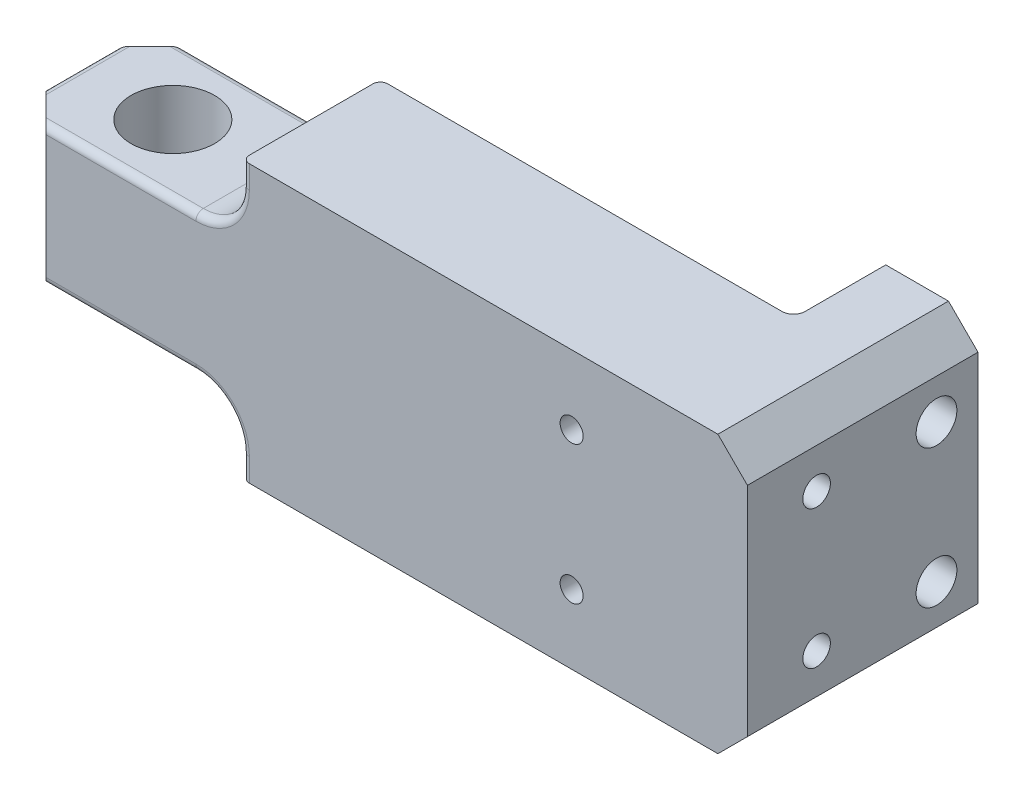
ISO-10303-21;
HEADER;
FILE_DESCRIPTION(('STEP AP214'),'2;1');
FILE_NAME('part.step','',(''),(''),'','','');
FILE_SCHEMA(('AUTOMOTIVE_DESIGN { 1 0 10303 214 1 1 1 1 }'));
ENDSEC;
DATA;
#1=APPLICATION_CONTEXT('core data for automotive mechanical design processes');
#2=APPLICATION_PROTOCOL_DEFINITION('international standard','automotive_design',2000,#1);
#3=PRODUCT_CONTEXT('',#1,'mechanical');
#4=PRODUCT('Part','Part','',(#3));
#5=PRODUCT_RELATED_PRODUCT_CATEGORY('part','',(#4));
#6=PRODUCT_DEFINITION_FORMATION('','',#4);
#7=PRODUCT_DEFINITION_CONTEXT('part definition',#1,'design');
#8=PRODUCT_DEFINITION('design','',#6,#7);
#9=PRODUCT_DEFINITION_SHAPE('','',#8);
#10=(LENGTH_UNIT() NAMED_UNIT(*) SI_UNIT(.MILLI.,.METRE.));
#11=(NAMED_UNIT(*) PLANE_ANGLE_UNIT() SI_UNIT($,.RADIAN.));
#12=(NAMED_UNIT(*) SI_UNIT($,.STERADIAN.) SOLID_ANGLE_UNIT());
#13=UNCERTAINTY_MEASURE_WITH_UNIT(LENGTH_MEASURE(1.E-05),#10,'distance_accuracy_value','');
#14=(GEOMETRIC_REPRESENTATION_CONTEXT(3) GLOBAL_UNCERTAINTY_ASSIGNED_CONTEXT((#13)) GLOBAL_UNIT_ASSIGNED_CONTEXT((#10,
#11,#12)) REPRESENTATION_CONTEXT('',''));
#15=CARTESIAN_POINT('',(0.,0.,0.));
#16=DIRECTION('',(0.,0.,1.));
#17=DIRECTION('',(1.,0.,0.));
#18=AXIS2_PLACEMENT_3D('',#15,#16,#17);
#19=CARTESIAN_POINT('',(77.0001000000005,9.52500000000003,0.));
#20=DIRECTION('',(1.,0.,0.));
#21=DIRECTION('',(0.,0.,-1.));
#22=AXIS2_PLACEMENT_3D('',#19,#20,#21);
#23=CONICAL_SURFACE('',#22,1.89864999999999,1.02974425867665);
#24=CARTESIAN_POINT('',(77.0001000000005,9.52500000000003,0.));
#25=DIRECTION('',(1.,0.,0.));
#26=DIRECTION('',(0.,0.,-1.));
#27=AXIS2_PLACEMENT_3D('',#24,#25,#26);
#28=CIRCLE('',#27,1.89864999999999);
#29=CARTESIAN_POINT('',(77.0001000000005,11.1063412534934,-1.05082427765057));
#30=VERTEX_POINT('',#29);
#31=CARTESIAN_POINT('',(77.0001,11.1063412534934,1.05082427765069));
#32=VERTEX_POINT('',#31);
#33=EDGE_CURVE('E261',#30,#32,#28,.T.);
#34=ORIENTED_EDGE('',*,*,#33,.T.);
#35=CARTESIAN_POINT('',(77.1143824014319,11.1122965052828,1.3578568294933));
#36=CARTESIAN_POINT('',(77.0957161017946,11.1119997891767,1.31040235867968));
#37=CARTESIAN_POINT('',(77.0773936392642,11.1113741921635,1.26281613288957));
#38=CARTESIAN_POINT('',(77.041622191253,11.1095622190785,1.16731325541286));
#39=CARTESIAN_POINT('',(77.0241734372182,11.1083756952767,1.11939651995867));
#40=CARTESIAN_POINT('',(76.9731751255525,11.1040993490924,0.974359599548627));
#41=CARTESIAN_POINT('',(76.9412620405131,11.1003001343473,0.876669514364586));
#42=CARTESIAN_POINT('',(76.8849030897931,11.0921546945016,0.681740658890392));
#43=CARTESIAN_POINT('',(76.8602923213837,11.0878242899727,0.584550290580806));
#44=CARTESIAN_POINT('',(76.8208831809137,11.0802701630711,0.388361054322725));
#45=CARTESIAN_POINT('',(76.806051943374,11.077042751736,0.28936940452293));
#46=CARTESIAN_POINT('',(76.7906825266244,11.073653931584,0.10648338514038));
#47=CARTESIAN_POINT('',(76.7882030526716,11.0730773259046,0.0227684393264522));
#48=CARTESIAN_POINT('',(76.7927582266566,11.0741034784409,-0.144435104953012));
#49=CARTESIAN_POINT('',(76.7997999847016,11.075707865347,-0.227923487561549));
#50=CARTESIAN_POINT('',(76.8221394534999,11.0804324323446,-0.393889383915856));
#51=CARTESIAN_POINT('',(76.8374576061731,11.0835563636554,-0.47636387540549));
#52=CARTESIAN_POINT('',(76.8742998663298,11.0902521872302,-0.639868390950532));
#53=CARTESIAN_POINT('',(76.8958259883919,11.0938242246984,-0.720897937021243));
#54=CARTESIAN_POINT('',(76.9474258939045,11.1010512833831,-0.895851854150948));
#55=CARTESIAN_POINT('',(76.9783377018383,11.1046097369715,-0.989528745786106));
#56=CARTESIAN_POINT('',(77.0275484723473,11.1086123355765,-1.12870883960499));
#57=CARTESIAN_POINT('',(77.0443662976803,11.1097225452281,-1.17473126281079));
#58=CARTESIAN_POINT('',(77.0788103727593,11.1114218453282,-1.26649537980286));
#59=CARTESIAN_POINT('',(77.0964368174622,11.1120108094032,-1.31223700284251));
#60=CARTESIAN_POINT('',(77.1143824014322,11.1122965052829,-1.35785682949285));
#61=B_SPLINE_CURVE_WITH_KNOTS('',3,(#35,#36,#37,#38,#39,#40,#41,#42,#43,#44,#45,#46,#47,#48,#49,
#50,#51,#52,#53,#54,#55,#56,#57,#58,#59,#60),.UNSPECIFIED.,.F.,.F.,(4,2,2,2,2,2,2,2,2,2,2,2,4),
(0.,0.152977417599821,0.305995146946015,0.614346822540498,0.915085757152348,1.21480879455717,
1.4655000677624,1.71637865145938,1.9678797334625,2.21946252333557,2.51543627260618,
2.66246427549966,2.80952791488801),.UNSPECIFIED.);
#62=EDGE_CURVE('E11',#32,#30,#61,.T.);
#63=ORIENTED_EDGE('',*,*,#62,.T.);
#64=EDGE_LOOP('',(#34,#63));
#65=FACE_BOUND('',#64,.T.);
#66=ADVANCED_FACE('F42',(#65),#23,.F.);
#67=CARTESIAN_POINT('',(77.0001000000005,-9.52500000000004,0.));
#68=DIRECTION('',(1.,0.,0.));
#69=DIRECTION('',(0.,0.,-1.));
#70=AXIS2_PLACEMENT_3D('',#67,#68,#69);
#71=CONICAL_SURFACE('',#70,1.89864999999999,1.02974425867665);
#72=CARTESIAN_POINT('',(77.0001000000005,-9.52500000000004,0.));
#73=DIRECTION('',(1.,0.,0.));
#74=DIRECTION('',(0.,0.,-1.));
#75=AXIS2_PLACEMENT_3D('',#72,#73,#74);
#76=CIRCLE('',#75,1.89864999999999);
#77=CARTESIAN_POINT('',(77.0001000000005,-7.94365874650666,-1.05082427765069));
#78=VERTEX_POINT('',#77);
#79=CARTESIAN_POINT('',(77.0001000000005,-7.94365874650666,1.05082427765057));
#80=VERTEX_POINT('',#79);
#81=EDGE_CURVE('E276',#78,#80,#76,.T.);
#82=ORIENTED_EDGE('',*,*,#81,.T.);
#83=CARTESIAN_POINT('',(77.1143824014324,-7.93770349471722,1.3578568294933));
#84=CARTESIAN_POINT('',(77.0957161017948,-7.93800021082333,1.31040235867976));
#85=CARTESIAN_POINT('',(77.0773936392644,-7.93862580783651,1.26281613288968));
#86=CARTESIAN_POINT('',(77.0416221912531,-7.94043778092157,1.16731325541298));
#87=CARTESIAN_POINT('',(77.0241734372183,-7.94162430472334,1.11939651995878));
#88=CARTESIAN_POINT('',(76.9731751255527,-7.94590065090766,0.9743595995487));
#89=CARTESIAN_POINT('',(76.9412620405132,-7.94969986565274,0.876669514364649));
#90=CARTESIAN_POINT('',(76.8849030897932,-7.95784530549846,0.681740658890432));
#91=CARTESIAN_POINT('',(76.8602923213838,-7.96217571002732,0.584550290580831));
#92=CARTESIAN_POINT('',(76.8208831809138,-7.9697298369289,0.388361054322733));
#93=CARTESIAN_POINT('',(76.806051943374,-7.9729572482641,0.289369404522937));
#94=CARTESIAN_POINT('',(76.7906825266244,-7.97634606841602,0.106483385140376));
#95=CARTESIAN_POINT('',(76.7882030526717,-7.9769226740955,0.0227684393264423));
#96=CARTESIAN_POINT('',(76.7927582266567,-7.9758965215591,-0.144435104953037));
#97=CARTESIAN_POINT('',(76.7997999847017,-7.97429213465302,-0.227923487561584));
#98=CARTESIAN_POINT('',(76.8221394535,-7.96956756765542,-0.393889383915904));
#99=CARTESIAN_POINT('',(76.8374576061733,-7.96644363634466,-0.476363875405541));
#100=CARTESIAN_POINT('',(76.8742998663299,-7.95974781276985,-0.639868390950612));
#101=CARTESIAN_POINT('',(76.895825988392,-7.95617577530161,-0.720897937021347));
#102=CARTESIAN_POINT('',(76.9474258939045,-7.94894871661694,-0.895851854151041));
#103=CARTESIAN_POINT('',(76.9783377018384,-7.94539026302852,-0.989528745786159));
#104=CARTESIAN_POINT('',(77.0275484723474,-7.9413876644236,-1.128708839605));
#105=CARTESIAN_POINT('',(77.0443662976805,-7.94027745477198,-1.17473126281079));
#106=CARTESIAN_POINT('',(77.0788103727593,-7.93857815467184,-1.26649537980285));
#107=CARTESIAN_POINT('',(77.0964368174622,-7.93798919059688,-1.3122370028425));
#108=CARTESIAN_POINT('',(77.1143824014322,-7.93770349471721,-1.35785682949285));
#109=B_SPLINE_CURVE_WITH_KNOTS('',3,(#83,#84,#85,#86,#87,#88,#89,#90,#91,#92,#93,#94,#95,#96,
#97,#98,#99,#100,#101,#102,#103,#104,#105,#106,#107,#108),.UNSPECIFIED.,.F.,.F.,(4,2,2,2,2,2,2,
2,2,2,2,2,4),(0.,0.152977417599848,0.305995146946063,0.614346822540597,0.915085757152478,
1.21480879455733,1.46550006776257,1.71637865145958,1.96787973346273,2.21946252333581,
2.51543627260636,2.66246427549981,2.80952791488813),.UNSPECIFIED.);
#110=EDGE_CURVE('E254',#80,#78,#109,.T.);
#111=ORIENTED_EDGE('',*,*,#110,.T.);
#112=EDGE_LOOP('',(#82,#111));
#113=FACE_BOUND('',#112,.T.);
#114=ADVANCED_FACE('F612',(#113),#71,.F.);
#115=CARTESIAN_POINT('',(25.4000000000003,15.8750000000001,-9.52500000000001));
#116=DIRECTION('',(0.,0.,1.));
#117=DIRECTION('',(1.,0.,0.));
#118=AXIS2_PLACEMENT_3D('',#115,#116,#117);
#119=PLANE('',#118);
#120=CARTESIAN_POINT('',(77.1398000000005,9.52500000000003,-9.52500000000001));
#121=DIRECTION('',(0.,0.,-1.));
#122=DIRECTION('',(-1.,0.,0.));
#123=AXIS2_PLACEMENT_3D('',#120,#121,#122);
#124=CIRCLE('',#123,1.5875);
#125=CARTESIAN_POINT('',(75.5523000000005,9.52500000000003,-9.52500000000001));
#126=VERTEX_POINT('',#125);
#127=EDGE_CURVE('E1097',#126,#126,#124,.T.);
#128=ORIENTED_EDGE('',*,*,#127,.F.);
#129=EDGE_LOOP('',(#128));
#130=FACE_BOUND('',#129,.T.);
#131=CARTESIAN_POINT('',(77.1398000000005,-9.52500000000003,-9.52500000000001));
#132=DIRECTION('',(0.,0.,-1.));
#133=DIRECTION('',(-1.,0.,0.));
#134=AXIS2_PLACEMENT_3D('',#131,#132,#133);
#135=CIRCLE('',#134,1.5875);
#136=CARTESIAN_POINT('',(75.5523000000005,-9.52500000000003,-9.52500000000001));
#137=VERTEX_POINT('',#136);
#138=EDGE_CURVE('E689',#137,#137,#135,.T.);
#139=ORIENTED_EDGE('',*,*,#138,.F.);
#140=EDGE_LOOP('',(#139));
#141=FACE_BOUND('',#140,.T.);
#142=DIRECTION('',(-1.,0.,0.));
#143=VECTOR('',#142,1.);
#144=CARTESIAN_POINT('',(31.7500000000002,19.0500000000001,-9.52499999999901));
#145=LINE('',#144,#143);
#146=CARTESIAN_POINT('',(87.0585000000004,19.0500000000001,-9.52499999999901));
#147=VERTEX_POINT('',#146);
#148=CARTESIAN_POINT('',(32.7660000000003,19.0500000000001,-9.52499999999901));
#149=VERTEX_POINT('',#148);
#150=EDGE_CURVE('E311',#147,#149,#145,.T.);
#151=ORIENTED_EDGE('',*,*,#150,.F.);
#152=DIRECTION('',(0.,1.,0.));
#153=VECTOR('',#152,1.);
#154=CARTESIAN_POINT('',(87.0585000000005,-19.05,-9.52499999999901));
#155=LINE('',#154,#153);
#156=CARTESIAN_POINT('',(87.0585000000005,-19.05,-9.52499999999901));
#157=VERTEX_POINT('',#156);
#158=EDGE_CURVE('E468',#147,#157,#155,.F.);
#159=ORIENTED_EDGE('',*,*,#158,.T.);
#160=DIRECTION('',(1.,0.,0.));
#161=VECTOR('',#160,1.);
#162=CARTESIAN_POINT('',(31.7500000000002,-19.0500000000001,-9.52500000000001));
#163=LINE('',#162,#161);
#164=CARTESIAN_POINT('',(32.7660000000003,-19.05,-9.52500000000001));
#165=VERTEX_POINT('',#164);
#166=EDGE_CURVE('E308',#165,#157,#163,.T.);
#167=ORIENTED_EDGE('',*,*,#166,.F.);
#168=DIRECTION('',(0.,-1.,0.));
#169=VECTOR('',#168,1.);
#170=CARTESIAN_POINT('',(32.7660000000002,15.8750000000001,-9.52499999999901));
#171=LINE('',#170,#169);
#172=CARTESIAN_POINT('',(32.7660000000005,-15.875,-9.52500000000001));
#173=VERTEX_POINT('',#172);
#174=EDGE_CURVE('E385',#165,#173,#171,.F.);
#175=ORIENTED_EDGE('',*,*,#174,.T.);
#176=CARTESIAN_POINT('',(25.4000000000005,-15.8750000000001,-9.52499999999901));
#177=DIRECTION('',(0.,0.,1.));
#178=DIRECTION('',(1.,0.,0.));
#179=AXIS2_PLACEMENT_3D('',#176,#177,#178);
#180=CIRCLE('',#179,7.366);
#181=CARTESIAN_POINT('',(25.4000000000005,-8.50900000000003,-9.52500000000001));
#182=VERTEX_POINT('',#181);
#183=EDGE_CURVE('E383',#173,#182,#180,.T.);
#184=ORIENTED_EDGE('',*,*,#183,.T.);
#185=DIRECTION('',(1.,0.,0.));
#186=VECTOR('',#185,1.);
#187=CARTESIAN_POINT('',(25.4000000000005,-8.50900000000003,-9.52500000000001));
#188=LINE('',#187,#186);
#189=CARTESIAN_POINT('',(4.76250000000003,-8.50900000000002,-9.52500000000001));
#190=VERTEX_POINT('',#189);
#191=EDGE_CURVE('E381',#182,#190,#188,.F.);
#192=ORIENTED_EDGE('',*,*,#191,.T.);
#193=DIRECTION('',(0.,1.,0.));
#194=VECTOR('',#193,1.);
#195=CARTESIAN_POINT('',(4.76250000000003,15.8750000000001,-9.5249999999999));
#196=LINE('',#195,#194);
#197=CARTESIAN_POINT('',(4.76250000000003,8.50900000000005,-9.52500000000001));
#198=VERTEX_POINT('',#197);
#199=EDGE_CURVE('E364',#190,#198,#196,.T.);
#200=ORIENTED_EDGE('',*,*,#199,.T.);
#201=DIRECTION('',(-1.,0.,0.));
#202=VECTOR('',#201,1.);
#203=CARTESIAN_POINT('',(25.4000000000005,8.50900000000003,-9.52500000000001));
#204=LINE('',#203,#202);
#205=CARTESIAN_POINT('',(25.4000000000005,8.50900000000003,-9.52500000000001));
#206=VERTEX_POINT('',#205);
#207=EDGE_CURVE('E387',#198,#206,#204,.F.);
#208=ORIENTED_EDGE('',*,*,#207,.T.);
#209=CARTESIAN_POINT('',(25.4000000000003,15.8750000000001,-9.52500000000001));
#210=DIRECTION('',(0.,0.,1.));
#211=DIRECTION('',(1.,0.,0.));
#212=AXIS2_PLACEMENT_3D('',#209,#210,#211);
#213=CIRCLE('',#212,7.366);
#214=CARTESIAN_POINT('',(32.7660000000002,15.8750000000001,-9.52499999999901));
#215=VERTEX_POINT('',#214);
#216=EDGE_CURVE('E389',#206,#215,#213,.T.);
#217=ORIENTED_EDGE('',*,*,#216,.T.);
#218=DIRECTION('',(0.,-1.,0.));
#219=VECTOR('',#218,1.);
#220=CARTESIAN_POINT('',(32.7660000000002,15.8750000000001,-9.52499999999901));
#221=LINE('',#220,#219);
#222=EDGE_CURVE('E391',#215,#149,#221,.F.);
#223=ORIENTED_EDGE('',*,*,#222,.T.);
#224=EDGE_LOOP('',(#151,#159,#167,#175,#184,#192,#200,#208,#217,#223));
#225=FACE_BOUND('',#224,.T.);
#226=ADVANCED_FACE('F609',(#130,#141,#225),#119,.F.);
#227=CARTESIAN_POINT('',(25.4000000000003,15.875,9.52500000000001));
#228=DIRECTION('',(0.,0.,-1.));
#229=DIRECTION('',(-1.,0.,0.));
#230=AXIS2_PLACEMENT_3D('',#227,#228,#229);
#231=CYLINDRICAL_SURFACE('',#230,6.35);
#232=DIRECTION('',(0.,0.,-1.));
#233=VECTOR('',#232,1.);
#234=CARTESIAN_POINT('',(31.7500000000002,15.875,9.52500000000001));
#235=LINE('',#234,#233);
#236=CARTESIAN_POINT('',(31.7500000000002,15.8750000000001,8.5090000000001));
#237=VERTEX_POINT('',#236);
#238=CARTESIAN_POINT('',(31.7500000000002,15.875,-8.50899999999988));
#239=VERTEX_POINT('',#238);
#240=EDGE_CURVE('E321',#237,#239,#235,.T.);
#241=ORIENTED_EDGE('',*,*,#240,.T.);
#242=CARTESIAN_POINT('',(25.4000000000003,15.875,-8.50899999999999));
#243=DIRECTION('',(0.,0.,1.));
#244=DIRECTION('',(1.,0.,0.));
#245=AXIS2_PLACEMENT_3D('',#242,#243,#244);
#246=CIRCLE('',#245,6.35);
#247=CARTESIAN_POINT('',(25.4000000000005,9.52500000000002,-8.50899999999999));
#248=VERTEX_POINT('',#247);
#249=EDGE_CURVE('E423',#239,#248,#246,.F.);
#250=ORIENTED_EDGE('',*,*,#249,.T.);
#251=DIRECTION('',(0.,0.,-1.));
#252=VECTOR('',#251,1.);
#253=CARTESIAN_POINT('',(25.4000000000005,9.52500000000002,9.52500000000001));
#254=LINE('',#253,#252);
#255=CARTESIAN_POINT('',(25.4000000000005,9.52500000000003,8.50899999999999));
#256=VERTEX_POINT('',#255);
#257=EDGE_CURVE('E336',#256,#248,#254,.T.);
#258=ORIENTED_EDGE('',*,*,#257,.F.);
#259=CARTESIAN_POINT('',(25.4000000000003,15.8750000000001,8.50899999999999));
#260=DIRECTION('',(0.,0.,1.));
#261=DIRECTION('',(1.,0.,0.));
#262=AXIS2_PLACEMENT_3D('',#259,#260,#261);
#263=CIRCLE('',#262,6.35);
#264=EDGE_CURVE('E421',#256,#237,#263,.T.);
#265=ORIENTED_EDGE('',*,*,#264,.T.);
#266=EDGE_LOOP('',(#241,#250,#258,#265));
#267=FACE_BOUND('',#266,.T.);
#268=ADVANCED_FACE('F44',(#267),#231,.F.);
#269=CARTESIAN_POINT('',(2.4980018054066E-13,9.52500000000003,9.52500000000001));
#270=DIRECTION('',(0.,-1.,0.));
#271=DIRECTION('',(0.,0.,-1.));
#272=AXIS2_PLACEMENT_3D('',#269,#270,#271);
#273=PLANE('',#272);
#274=CARTESIAN_POINT('',(12.7000000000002,9.52500000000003,0.));
#275=DIRECTION('',(0.,1.,0.));
#276=DIRECTION('',(0.,0.,1.));
#277=AXIS2_PLACEMENT_3D('',#274,#275,#276);
#278=CIRCLE('',#277,5.754751);
#279=CARTESIAN_POINT('',(12.7000000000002,9.52500000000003,5.754751));
#280=VERTEX_POINT('',#279);
#281=EDGE_CURVE('E282',#280,#280,#278,.T.);
#282=ORIENTED_EDGE('',*,*,#281,.F.);
#283=EDGE_LOOP('',(#282));
#284=FACE_BOUND('',#283,.T.);
#285=ORIENTED_EDGE('',*,*,#257,.T.);
#286=DIRECTION('',(-1.,0.,0.));
#287=VECTOR('',#286,1.);
#288=CARTESIAN_POINT('',(2.4980018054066E-13,9.52500000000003,-8.50899999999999));
#289=LINE('',#288,#287);
#290=CARTESIAN_POINT('',(3.74650000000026,9.52500000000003,-8.50899999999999));
#291=VERTEX_POINT('',#290);
#292=EDGE_CURVE('E433',#248,#291,#289,.T.);
#293=ORIENTED_EDGE('',*,*,#292,.T.);
#294=DIRECTION('',(0.707106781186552,0.,-0.707106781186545));
#295=VECTOR('',#294,1.);
#296=CARTESIAN_POINT('',(0.,9.52500000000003,-4.7625));
#297=LINE('',#296,#295);
#298=CARTESIAN_POINT('',(1.01599999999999,9.52500000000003,-5.77850000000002));
#299=VERTEX_POINT('',#298);
#300=EDGE_CURVE('E370',#291,#299,#297,.F.);
#301=ORIENTED_EDGE('',*,*,#300,.T.);
#302=DIRECTION('',(0.,0.,-1.));
#303=VECTOR('',#302,1.);
#304=CARTESIAN_POINT('',(1.01600000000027,9.52500000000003,9.52500000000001));
#305=LINE('',#304,#303);
#306=CARTESIAN_POINT('',(1.01599999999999,9.52500000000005,5.77850000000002));
#307=VERTEX_POINT('',#306);
#308=EDGE_CURVE('E429',#299,#307,#305,.F.);
#309=ORIENTED_EDGE('',*,*,#308,.T.);
#310=DIRECTION('',(0.707106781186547,0.,0.70710678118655));
#311=VECTOR('',#310,1.);
#312=CARTESIAN_POINT('',(4.76250000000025,9.52500000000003,9.52500000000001));
#313=LINE('',#312,#311);
#314=CARTESIAN_POINT('',(3.74650000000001,9.52500000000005,8.50899999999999));
#315=VERTEX_POINT('',#314);
#316=EDGE_CURVE('E367',#307,#315,#313,.T.);
#317=ORIENTED_EDGE('',*,*,#316,.T.);
#318=DIRECTION('',(-1.,0.,0.));
#319=VECTOR('',#318,1.);
#320=CARTESIAN_POINT('',(25.4000000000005,9.52500000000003,8.50899999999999));
#321=LINE('',#320,#319);
#322=EDGE_CURVE('E431',#315,#256,#321,.F.);
#323=ORIENTED_EDGE('',*,*,#322,.T.);
#324=EDGE_LOOP('',(#285,#293,#301,#309,#317,#323));
#325=FACE_BOUND('',#324,.T.);
#326=ADVANCED_FACE('F647',(#284,#325),#273,.F.);
#327=CARTESIAN_POINT('',(0.,-9.52500000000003,9.52500000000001));
#328=DIRECTION('',(1.,0.,0.));
#329=DIRECTION('',(0.,0.,-1.));
#330=AXIS2_PLACEMENT_3D('',#327,#328,#329);
#331=PLANE('',#330);
#332=DIRECTION('',(0.,1.,0.));
#333=VECTOR('',#332,1.);
#334=CARTESIAN_POINT('',(0.,9.52500000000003,4.7625));
#335=LINE('',#334,#333);
#336=CARTESIAN_POINT('',(0.,-8.50900000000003,4.7625));
#337=VERTEX_POINT('',#336);
#338=CARTESIAN_POINT('',(0.,8.50900000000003,4.7625));
#339=VERTEX_POINT('',#338);
#340=EDGE_CURVE('E352',#337,#339,#335,.T.);
#341=ORIENTED_EDGE('',*,*,#340,.T.);
#342=DIRECTION('',(0.,0.,-1.));
#343=VECTOR('',#342,1.);
#344=CARTESIAN_POINT('',(2.4980018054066E-13,8.50900000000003,9.52500000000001));
#345=LINE('',#344,#343);
#346=CARTESIAN_POINT('',(0.,8.50900000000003,-4.7625));
#347=VERTEX_POINT('',#346);
#348=EDGE_CURVE('E460',#339,#347,#345,.T.);
#349=ORIENTED_EDGE('',*,*,#348,.T.);
#350=DIRECTION('',(0.,-1.,0.));
#351=VECTOR('',#350,1.);
#352=CARTESIAN_POINT('',(0.,-9.52500000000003,-4.7625));
#353=LINE('',#352,#351);
#354=CARTESIAN_POINT('',(0.,-8.50900000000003,-4.7625));
#355=VERTEX_POINT('',#354);
#356=EDGE_CURVE('E355',#347,#355,#353,.T.);
#357=ORIENTED_EDGE('',*,*,#356,.T.);
#358=DIRECTION('',(0.,0.,-1.));
#359=VECTOR('',#358,1.);
#360=CARTESIAN_POINT('',(2.4980018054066E-13,-8.50900000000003,9.52500000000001));
#361=LINE('',#360,#359);
#362=EDGE_CURVE('E458',#355,#337,#361,.F.);
#363=ORIENTED_EDGE('',*,*,#362,.T.);
#364=EDGE_LOOP('',(#341,#349,#357,#363));
#365=FACE_BOUND('',#364,.T.);
#366=ADVANCED_FACE('F644',(#365),#331,.F.);
#367=CARTESIAN_POINT('',(0.,-9.52500000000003,9.52500000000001));
#368=DIRECTION('',(0.,1.,0.));
#369=DIRECTION('',(0.,0.,1.));
#370=AXIS2_PLACEMENT_3D('',#367,#368,#369);
#371=PLANE('',#370);
#372=CARTESIAN_POINT('',(12.7,-9.52500000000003,0.));
#373=DIRECTION('',(0.,1.,0.));
#374=DIRECTION('',(0.,0.,1.));
#375=AXIS2_PLACEMENT_3D('',#372,#373,#374);
#376=CIRCLE('',#375,5.75475099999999);
#377=CARTESIAN_POINT('',(12.7,-9.52500000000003,5.75475099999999));
#378=VERTEX_POINT('',#377);
#379=EDGE_CURVE('E285',#378,#378,#376,.T.);
#380=ORIENTED_EDGE('',*,*,#379,.T.);
#381=EDGE_LOOP('',(#380));
#382=FACE_BOUND('',#381,.T.);
#383=DIRECTION('',(0.,0.,-1.));
#384=VECTOR('',#383,1.);
#385=CARTESIAN_POINT('',(25.4000000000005,-9.52500000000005,9.52500000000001));
#386=LINE('',#385,#384);
#387=CARTESIAN_POINT('',(25.4000000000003,-9.52500000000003,8.50899999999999));
#388=VERTEX_POINT('',#387);
#389=CARTESIAN_POINT('',(25.4000000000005,-9.52500000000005,-8.50899999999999));
#390=VERTEX_POINT('',#389);
#391=EDGE_CURVE('E333',#388,#390,#386,.T.);
#392=ORIENTED_EDGE('',*,*,#391,.F.);
#393=DIRECTION('',(1.,0.,0.));
#394=VECTOR('',#393,1.);
#395=CARTESIAN_POINT('',(4.7625,-9.52500000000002,8.50899999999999));
#396=LINE('',#395,#394);
#397=CARTESIAN_POINT('',(3.74649999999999,-9.52500000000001,8.50899999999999));
#398=VERTEX_POINT('',#397);
#399=EDGE_CURVE('E456',#388,#398,#396,.F.);
#400=ORIENTED_EDGE('',*,*,#399,.T.);
#401=DIRECTION('',(-0.707106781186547,0.,-0.70710678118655));
#402=VECTOR('',#401,1.);
#403=CARTESIAN_POINT('',(4.7625,-9.52500000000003,9.52500000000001));
#404=LINE('',#403,#402);
#405=CARTESIAN_POINT('',(1.01600000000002,-9.52500000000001,5.77850000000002));
#406=VERTEX_POINT('',#405);
#407=EDGE_CURVE('E358',#398,#406,#404,.T.);
#408=ORIENTED_EDGE('',*,*,#407,.T.);
#409=DIRECTION('',(0.,0.,-1.));
#410=VECTOR('',#409,1.);
#411=CARTESIAN_POINT('',(1.01599999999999,-9.52500000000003,9.52500000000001));
#412=LINE('',#411,#410);
#413=CARTESIAN_POINT('',(1.01600000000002,-9.52500000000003,-5.77850000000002));
#414=VERTEX_POINT('',#413);
#415=EDGE_CURVE('E451',#406,#414,#412,.T.);
#416=ORIENTED_EDGE('',*,*,#415,.T.);
#417=DIRECTION('',(-0.707106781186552,0.,0.707106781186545));
#418=VECTOR('',#417,1.);
#419=CARTESIAN_POINT('',(0.,-9.52500000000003,-4.7625));
#420=LINE('',#419,#418);
#421=CARTESIAN_POINT('',(3.74650000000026,-9.52500000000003,-8.50899999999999));
#422=VERTEX_POINT('',#421);
#423=EDGE_CURVE('E361',#414,#422,#420,.F.);
#424=ORIENTED_EDGE('',*,*,#423,.T.);
#425=DIRECTION('',(1.,0.,0.));
#426=VECTOR('',#425,1.);
#427=CARTESIAN_POINT('',(2.4980018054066E-13,-9.52500000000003,-8.50899999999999));
#428=LINE('',#427,#426);
#429=EDGE_CURVE('E454',#422,#390,#428,.T.);
#430=ORIENTED_EDGE('',*,*,#429,.T.);
#431=EDGE_LOOP('',(#392,#400,#408,#416,#424,#430));
#432=FACE_BOUND('',#431,.T.);
#433=ADVANCED_FACE('F640',(#382,#432),#371,.F.);
#434=CARTESIAN_POINT('',(25.4000000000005,-15.8750000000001,9.525000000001));
#435=DIRECTION('',(0.,0.,-1.));
#436=DIRECTION('',(-1.,0.,0.));
#437=AXIS2_PLACEMENT_3D('',#434,#435,#436);
#438=CYLINDRICAL_SURFACE('',#437,6.35);
#439=DIRECTION('',(0.,0.,-1.));
#440=VECTOR('',#439,1.);
#441=CARTESIAN_POINT('',(31.7500000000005,-15.8750000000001,9.52500000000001));
#442=LINE('',#441,#440);
#443=CARTESIAN_POINT('',(31.7500000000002,-15.8750000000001,8.50899999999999));
#444=VERTEX_POINT('',#443);
#445=CARTESIAN_POINT('',(31.7500000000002,-15.8750000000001,-8.50899999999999));
#446=VERTEX_POINT('',#445);
#447=EDGE_CURVE('E330',#444,#446,#442,.T.);
#448=ORIENTED_EDGE('',*,*,#447,.F.);
#449=CARTESIAN_POINT('',(25.4000000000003,-15.8750000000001,8.50900000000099));
#450=DIRECTION('',(0.,0.,1.));
#451=DIRECTION('',(1.,0.,0.));
#452=AXIS2_PLACEMENT_3D('',#449,#450,#451);
#453=CIRCLE('',#452,6.35);
#454=EDGE_CURVE('E427',#444,#388,#453,.T.);
#455=ORIENTED_EDGE('',*,*,#454,.T.);
#456=ORIENTED_EDGE('',*,*,#391,.T.);
#457=CARTESIAN_POINT('',(25.4000000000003,-15.8750000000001,-8.50899999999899));
#458=DIRECTION('',(0.,0.,1.));
#459=DIRECTION('',(1.,0.,0.));
#460=AXIS2_PLACEMENT_3D('',#457,#458,#459);
#461=CIRCLE('',#460,6.35);
#462=EDGE_CURVE('E425',#390,#446,#461,.F.);
#463=ORIENTED_EDGE('',*,*,#462,.T.);
#464=EDGE_LOOP('',(#448,#455,#456,#463));
#465=FACE_BOUND('',#464,.T.);
#466=ADVANCED_FACE('F636',(#465),#438,.F.);
#467=CARTESIAN_POINT('',(31.7500000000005,-15.8750000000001,9.52500000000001));
#468=DIRECTION('',(1.,0.,0.));
#469=DIRECTION('',(0.,0.,-1.));
#470=AXIS2_PLACEMENT_3D('',#467,#468,#469);
#471=PLANE('',#470);
#472=DIRECTION('',(0.,0.,-1.));
#473=VECTOR('',#472,1.);
#474=CARTESIAN_POINT('',(31.7500000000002,-19.0500000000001,9.52500000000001));
#475=LINE('',#474,#473);
#476=CARTESIAN_POINT('',(31.7500000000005,-19.0500000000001,8.50899999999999));
#477=VERTEX_POINT('',#476);
#478=CARTESIAN_POINT('',(31.7500000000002,-19.0500000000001,-8.50899999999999));
#479=VERTEX_POINT('',#478);
#480=EDGE_CURVE('E327',#477,#479,#475,.T.);
#481=ORIENTED_EDGE('',*,*,#480,.F.);
#482=DIRECTION('',(0.,-1.,0.));
#483=VECTOR('',#482,1.);
#484=CARTESIAN_POINT('',(31.7500000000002,-15.8750000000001,8.50899999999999));
#485=LINE('',#484,#483);
#486=EDGE_CURVE('E419',#477,#444,#485,.F.);
#487=ORIENTED_EDGE('',*,*,#486,.T.);
#488=ORIENTED_EDGE('',*,*,#447,.T.);
#489=DIRECTION('',(0.,-1.,0.));
#490=VECTOR('',#489,1.);
#491=CARTESIAN_POINT('',(31.7500000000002,-15.8750000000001,-8.50899999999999));
#492=LINE('',#491,#490);
#493=EDGE_CURVE('E416',#446,#479,#492,.T.);
#494=ORIENTED_EDGE('',*,*,#493,.T.);
#495=EDGE_LOOP('',(#481,#487,#488,#494));
#496=FACE_BOUND('',#495,.T.);
#497=ADVANCED_FACE('F632',(#496),#471,.F.);
#498=CARTESIAN_POINT('',(31.7500000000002,-19.0500000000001,9.52500000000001));
#499=DIRECTION('',(0.,1.,0.));
#500=DIRECTION('',(0.,0.,1.));
#501=AXIS2_PLACEMENT_3D('',#498,#499,#500);
#502=PLANE('',#501);
#503=DIRECTION('',(1.,0.,0.));
#504=VECTOR('',#503,1.);
#505=CARTESIAN_POINT('',(31.7500000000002,-19.0500000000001,9.52500000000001));
#506=LINE('',#505,#504);
#507=CARTESIAN_POINT('',(32.7660000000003,-19.0500000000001,9.52500000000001));
#508=VERTEX_POINT('',#507);
#509=CARTESIAN_POINT('',(97.2820000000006,-19.0500000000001,9.52500000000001));
#510=VERTEX_POINT('',#509);
#511=EDGE_CURVE('E313',#508,#510,#506,.T.);
#512=ORIENTED_EDGE('',*,*,#511,.F.);
#513=CARTESIAN_POINT('',(32.7660000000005,-19.05,8.50899999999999));
#514=DIRECTION('',(0.,1.,0.));
#515=DIRECTION('',(0.,0.,1.));
#516=AXIS2_PLACEMENT_3D('',#513,#514,#515);
#517=CIRCLE('',#516,1.016);
#518=EDGE_CURVE('E414',#508,#477,#517,.F.);
#519=ORIENTED_EDGE('',*,*,#518,.T.);
#520=ORIENTED_EDGE('',*,*,#480,.T.);
#521=CARTESIAN_POINT('',(32.7660000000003,-19.0500000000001,-8.50899999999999));
#522=DIRECTION('',(0.,1.,0.));
#523=DIRECTION('',(0.,0.,1.));
#524=AXIS2_PLACEMENT_3D('',#521,#522,#523);
#525=CIRCLE('',#524,1.016);
#526=EDGE_CURVE('E412',#479,#165,#525,.F.);
#527=ORIENTED_EDGE('',*,*,#526,.T.);
#528=ORIENTED_EDGE('',*,*,#166,.T.);
#529=CARTESIAN_POINT('',(87.0585000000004,-19.0500000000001,-11.112499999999));
#530=DIRECTION('',(0.,1.,0.));
#531=DIRECTION('',(0.,0.,1.));
#532=AXIS2_PLACEMENT_3D('',#529,#530,#531);
#533=CIRCLE('',#532,1.5875);
#534=CARTESIAN_POINT('',(88.6460000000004,-19.0500000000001,-11.112499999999));
#535=VERTEX_POINT('',#534);
#536=EDGE_CURVE('E472',#157,#535,#533,.T.);
#537=ORIENTED_EDGE('',*,*,#536,.T.);
#538=DIRECTION('',(0.,0.,1.));
#539=VECTOR('',#538,1.);
#540=CARTESIAN_POINT('',(88.6460000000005,-19.0500000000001,-22.2249999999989));
#541=LINE('',#540,#539);
#542=CARTESIAN_POINT('',(88.6460000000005,-19.0500000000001,-22.2249999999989));
#543=VERTEX_POINT('',#542);
#544=EDGE_CURVE('E265',#543,#535,#541,.T.);
#545=ORIENTED_EDGE('',*,*,#544,.F.);
#546=DIRECTION('',(-1.,0.,0.));
#547=VECTOR('',#546,1.);
#548=CARTESIAN_POINT('',(97.2820000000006,-19.0500000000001,-22.2249999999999));
#549=LINE('',#548,#547);
#550=CARTESIAN_POINT('',(97.2820000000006,-19.0500000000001,-22.2249999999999));
#551=VERTEX_POINT('',#550);
#552=EDGE_CURVE('E739',#551,#543,#549,.T.);
#553=ORIENTED_EDGE('',*,*,#552,.F.);
#554=DIRECTION('',(0.,0.,1.));
#555=VECTOR('',#554,1.);
#556=CARTESIAN_POINT('',(97.2820000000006,-19.0500000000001,9.52500000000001));
#557=LINE('',#556,#555);
#558=EDGE_CURVE('E349',#551,#510,#557,.T.);
#559=ORIENTED_EDGE('',*,*,#558,.T.);
#560=EDGE_LOOP('',(#512,#519,#520,#527,#528,#537,#545,#553,#559));
#561=FACE_BOUND('',#560,.T.);
#562=ADVANCED_FACE('F628',(#561),#502,.F.);
#563=CARTESIAN_POINT('',(101.346000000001,-19.0500000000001,9.525000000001));
#564=DIRECTION('',(-1.,0.,0.));
#565=DIRECTION('',(0.,0.,1.));
#566=AXIS2_PLACEMENT_3D('',#563,#564,#565);
#567=PLANE('',#566);
#568=CARTESIAN_POINT('',(101.346000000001,-9.52500000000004,-16.51));
#569=DIRECTION('',(1.,0.,0.));
#570=DIRECTION('',(0.,0.,-1.));
#571=AXIS2_PLACEMENT_3D('',#568,#569,#570);
#572=CIRCLE('',#571,2.8067);
#573=CARTESIAN_POINT('',(101.346000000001,-9.52500000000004,-19.3167));
#574=VERTEX_POINT('',#573);
#575=EDGE_CURVE('E483',#574,#574,#572,.T.);
#576=ORIENTED_EDGE('',*,*,#575,.F.);
#577=EDGE_LOOP('',(#576));
#578=FACE_BOUND('',#577,.T.);
#579=CARTESIAN_POINT('',(101.346,9.52500000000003,-16.51));
#580=DIRECTION('',(1.,0.,0.));
#581=DIRECTION('',(0.,0.,-1.));
#582=AXIS2_PLACEMENT_3D('',#579,#580,#581);
#583=CIRCLE('',#582,2.8067);
#584=CARTESIAN_POINT('',(101.346,9.52500000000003,-19.3167));
#585=VERTEX_POINT('',#584);
#586=EDGE_CURVE('E479',#585,#585,#583,.T.);
#587=ORIENTED_EDGE('',*,*,#586,.F.);
#588=EDGE_LOOP('',(#587));
#589=FACE_BOUND('',#588,.T.);
#590=CARTESIAN_POINT('',(101.346000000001,9.52500000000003,0.));
#591=DIRECTION('',(1.,0.,0.));
#592=DIRECTION('',(0.,0.,-1.));
#593=AXIS2_PLACEMENT_3D('',#590,#591,#592);
#594=CIRCLE('',#593,1.89865);
#595=CARTESIAN_POINT('',(101.346000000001,9.52500000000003,-1.89865));
#596=VERTEX_POINT('',#595);
#597=EDGE_CURVE('E267',#596,#596,#594,.T.);
#598=ORIENTED_EDGE('',*,*,#597,.F.);
#599=EDGE_LOOP('',(#598));
#600=FACE_BOUND('',#599,.T.);
#601=CARTESIAN_POINT('',(101.346000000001,-9.52500000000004,0.));
#602=DIRECTION('',(1.,0.,0.));
#603=DIRECTION('',(0.,0.,-1.));
#604=AXIS2_PLACEMENT_3D('',#601,#602,#603);
#605=CIRCLE('',#604,1.89865);
#606=CARTESIAN_POINT('',(101.346000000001,-9.52500000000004,-1.89865));
#607=VERTEX_POINT('',#606);
#608=EDGE_CURVE('E279',#607,#607,#605,.T.);
#609=ORIENTED_EDGE('',*,*,#608,.F.);
#610=EDGE_LOOP('',(#609));
#611=FACE_BOUND('',#610,.T.);
#612=DIRECTION('',(0.,0.,-1.));
#613=VECTOR('',#612,1.);
#614=CARTESIAN_POINT('',(101.346000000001,-14.986,9.52500000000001));
#615=LINE('',#614,#613);
#616=CARTESIAN_POINT('',(101.346000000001,-14.986,9.52500000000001));
#617=VERTEX_POINT('',#616);
#618=CARTESIAN_POINT('',(101.346000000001,-14.986,-22.2250000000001));
#619=VERTEX_POINT('',#618);
#620=EDGE_CURVE('E341',#617,#619,#615,.T.);
#621=ORIENTED_EDGE('',*,*,#620,.T.);
#622=DIRECTION('',(0.,-1.,0.));
#623=VECTOR('',#622,1.);
#624=CARTESIAN_POINT('',(101.346000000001,14.986,-22.2249999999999));
#625=LINE('',#624,#623);
#626=CARTESIAN_POINT('',(101.346000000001,14.986,-22.2249999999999));
#627=VERTEX_POINT('',#626);
#628=EDGE_CURVE('E747',#627,#619,#625,.T.);
#629=ORIENTED_EDGE('',*,*,#628,.F.);
#630=DIRECTION('',(0.,0.,1.));
#631=VECTOR('',#630,1.);
#632=CARTESIAN_POINT('',(101.346000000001,14.986,9.52500000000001));
#633=LINE('',#632,#631);
#634=CARTESIAN_POINT('',(101.346000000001,14.986,9.52500000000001));
#635=VERTEX_POINT('',#634);
#636=EDGE_CURVE('E343',#627,#635,#633,.T.);
#637=ORIENTED_EDGE('',*,*,#636,.T.);
#638=DIRECTION('',(0.,1.,0.));
#639=VECTOR('',#638,1.);
#640=CARTESIAN_POINT('',(101.346000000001,-19.0500000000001,9.525000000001));
#641=LINE('',#640,#639);
#642=EDGE_CURVE('E315',#617,#635,#641,.T.);
#643=ORIENTED_EDGE('',*,*,#642,.F.);
#644=EDGE_LOOP('',(#621,#629,#637,#643));
#645=FACE_BOUND('',#644,.T.);
#646=ADVANCED_FACE('F624',(#578,#589,#600,#611,#645),#567,.F.);
#647=CARTESIAN_POINT('',(31.7500000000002,19.05,9.52500000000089));
#648=DIRECTION('',(0.,-1.,0.));
#649=DIRECTION('',(0.,0.,-1.));
#650=AXIS2_PLACEMENT_3D('',#647,#648,#649);
#651=PLANE('',#650);
#652=DIRECTION('',(0.,0.,-1.));
#653=VECTOR('',#652,1.);
#654=CARTESIAN_POINT('',(97.2820000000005,19.0500000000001,9.52500000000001));
#655=LINE('',#654,#653);
#656=CARTESIAN_POINT('',(97.2820000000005,19.0500000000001,9.52500000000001));
#657=VERTEX_POINT('',#656);
#658=CARTESIAN_POINT('',(97.2820000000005,19.0500000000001,-22.2250000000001));
#659=VERTEX_POINT('',#658);
#660=EDGE_CURVE('E339',#657,#659,#655,.T.);
#661=ORIENTED_EDGE('',*,*,#660,.T.);
#662=DIRECTION('',(1.,0.,0.));
#663=VECTOR('',#662,1.);
#664=CARTESIAN_POINT('',(88.6460000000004,19.0500000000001,-22.224999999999));
#665=LINE('',#664,#663);
#666=CARTESIAN_POINT('',(88.6460000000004,19.0500000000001,-22.224999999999));
#667=VERTEX_POINT('',#666);
#668=EDGE_CURVE('E753',#667,#659,#665,.T.);
#669=ORIENTED_EDGE('',*,*,#668,.F.);
#670=DIRECTION('',(0.,0.,1.));
#671=VECTOR('',#670,1.);
#672=CARTESIAN_POINT('',(88.6460000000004,19.0500000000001,-22.224999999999));
#673=LINE('',#672,#671);
#674=CARTESIAN_POINT('',(88.6460000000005,19.0500000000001,-11.1124999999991));
#675=VERTEX_POINT('',#674);
#676=EDGE_CURVE('E269',#667,#675,#673,.T.);
#677=ORIENTED_EDGE('',*,*,#676,.T.);
#678=CARTESIAN_POINT('',(87.0585000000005,19.0500000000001,-11.1124999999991));
#679=DIRECTION('',(0.,-1.,0.));
#680=DIRECTION('',(0.,0.,-1.));
#681=AXIS2_PLACEMENT_3D('',#678,#679,#680);
#682=CIRCLE('',#681,1.5875);
#683=EDGE_CURVE('E470',#675,#147,#682,.T.);
#684=ORIENTED_EDGE('',*,*,#683,.T.);
#685=ORIENTED_EDGE('',*,*,#150,.T.);
#686=CARTESIAN_POINT('',(32.7660000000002,19.0500000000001,-8.5089999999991));
#687=DIRECTION('',(0.,-1.,0.));
#688=DIRECTION('',(0.,0.,-1.));
#689=AXIS2_PLACEMENT_3D('',#686,#687,#688);
#690=CIRCLE('',#689,1.016);
#691=CARTESIAN_POINT('',(31.7500000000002,19.05,-8.50899999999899));
#692=VERTEX_POINT('',#691);
#693=EDGE_CURVE('E396',#149,#692,#690,.F.);
#694=ORIENTED_EDGE('',*,*,#693,.T.);
#695=DIRECTION('',(0.,0.,-1.));
#696=VECTOR('',#695,1.);
#697=CARTESIAN_POINT('',(31.7500000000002,19.05,9.52500000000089));
#698=LINE('',#697,#696);
#699=CARTESIAN_POINT('',(31.7500000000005,19.0500000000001,8.50900000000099));
#700=VERTEX_POINT('',#699);
#701=EDGE_CURVE('E324',#700,#692,#698,.T.);
#702=ORIENTED_EDGE('',*,*,#701,.F.);
#703=CARTESIAN_POINT('',(32.7660000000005,19.0500000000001,8.50900000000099));
#704=DIRECTION('',(0.,-1.,0.));
#705=DIRECTION('',(0.,0.,-1.));
#706=AXIS2_PLACEMENT_3D('',#703,#704,#705);
#707=CIRCLE('',#706,1.016);
#708=CARTESIAN_POINT('',(32.7660000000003,19.0500000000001,9.525000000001));
#709=VERTEX_POINT('',#708);
#710=EDGE_CURVE('E394',#700,#709,#707,.F.);
#711=ORIENTED_EDGE('',*,*,#710,.T.);
#712=DIRECTION('',(-1.,0.,0.));
#713=VECTOR('',#712,1.);
#714=CARTESIAN_POINT('',(31.7500000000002,19.05,9.52500000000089));
#715=LINE('',#714,#713);
#716=EDGE_CURVE('E318',#657,#709,#715,.T.);
#717=ORIENTED_EDGE('',*,*,#716,.F.);
#718=EDGE_LOOP('',(#661,#669,#677,#684,#685,#694,#702,#711,#717));
#719=FACE_BOUND('',#718,.T.);
#720=ADVANCED_FACE('F620',(#719),#651,.F.);
#721=CARTESIAN_POINT('',(31.7500000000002,15.875,9.52500000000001));
#722=DIRECTION('',(1.,0.,0.));
#723=DIRECTION('',(0.,0.,-1.));
#724=AXIS2_PLACEMENT_3D('',#721,#722,#723);
#725=PLANE('',#724);
#726=ORIENTED_EDGE('',*,*,#701,.T.);
#727=DIRECTION('',(0.,-1.,0.));
#728=VECTOR('',#727,1.);
#729=CARTESIAN_POINT('',(31.7500000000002,15.875,-8.50899999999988));
#730=LINE('',#729,#728);
#731=EDGE_CURVE('E378',#692,#239,#730,.T.);
#732=ORIENTED_EDGE('',*,*,#731,.T.);
#733=ORIENTED_EDGE('',*,*,#240,.F.);
#734=DIRECTION('',(0.,-1.,0.));
#735=VECTOR('',#734,1.);
#736=CARTESIAN_POINT('',(31.7500000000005,19.0500000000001,8.50900000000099));
#737=LINE('',#736,#735);
#738=EDGE_CURVE('E376',#237,#700,#737,.F.);
#739=ORIENTED_EDGE('',*,*,#738,.T.);
#740=EDGE_LOOP('',(#726,#732,#733,#739));
#741=FACE_BOUND('',#740,.T.);
#742=ADVANCED_FACE('F616',(#741),#725,.F.);
#743=CARTESIAN_POINT('',(25.4000000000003,15.875,9.52500000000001));
#744=DIRECTION('',(0.,0.,1.));
#745=DIRECTION('',(1.,0.,0.));
#746=AXIS2_PLACEMENT_3D('',#743,#744,#745);
#747=PLANE('',#746);
#748=CARTESIAN_POINT('',(77.1398000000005,9.52500000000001,9.52500000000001));
#749=DIRECTION('',(0.,0.,-1.));
#750=DIRECTION('',(-1.,0.,0.));
#751=AXIS2_PLACEMENT_3D('',#748,#749,#750);
#752=CIRCLE('',#751,1.5875);
#753=CARTESIAN_POINT('',(75.5523000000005,9.52500000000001,9.52500000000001));
#754=VERTEX_POINT('',#753);
#755=EDGE_CURVE('E262',#754,#754,#752,.T.);
#756=ORIENTED_EDGE('',*,*,#755,.T.);
#757=EDGE_LOOP('',(#756));
#758=FACE_BOUND('',#757,.T.);
#759=CARTESIAN_POINT('',(77.1398000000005,-9.52500000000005,9.52500000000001));
#760=DIRECTION('',(0.,0.,-1.));
#761=DIRECTION('',(-1.,0.,0.));
#762=AXIS2_PLACEMENT_3D('',#759,#760,#761);
#763=CIRCLE('',#762,1.5875);
#764=CARTESIAN_POINT('',(75.5523000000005,-9.52500000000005,9.52500000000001));
#765=VERTEX_POINT('',#764);
#766=EDGE_CURVE('E519',#765,#765,#763,.T.);
#767=ORIENTED_EDGE('',*,*,#766,.T.);
#768=EDGE_LOOP('',(#767));
#769=FACE_BOUND('',#768,.T.);
#770=ORIENTED_EDGE('',*,*,#716,.T.);
#771=DIRECTION('',(0.,-1.,0.));
#772=VECTOR('',#771,1.);
#773=CARTESIAN_POINT('',(32.7660000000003,15.8750000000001,9.52500000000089));
#774=LINE('',#773,#772);
#775=CARTESIAN_POINT('',(32.7660000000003,15.8750000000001,9.52500000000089));
#776=VERTEX_POINT('',#775);
#777=EDGE_CURVE('E409',#709,#776,#774,.T.);
#778=ORIENTED_EDGE('',*,*,#777,.T.);
#779=CARTESIAN_POINT('',(25.4000000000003,15.875,9.52500000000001));
#780=DIRECTION('',(0.,0.,1.));
#781=DIRECTION('',(1.,0.,0.));
#782=AXIS2_PLACEMENT_3D('',#779,#780,#781);
#783=CIRCLE('',#782,7.366);
#784=CARTESIAN_POINT('',(25.4000000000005,8.50900000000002,9.52500000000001));
#785=VERTEX_POINT('',#784);
#786=EDGE_CURVE('E407',#776,#785,#783,.F.);
#787=ORIENTED_EDGE('',*,*,#786,.T.);
#788=DIRECTION('',(-1.,0.,0.));
#789=VECTOR('',#788,1.);
#790=CARTESIAN_POINT('',(4.76250000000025,8.50900000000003,9.52500000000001));
#791=LINE('',#790,#789);
#792=CARTESIAN_POINT('',(4.76250000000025,8.50900000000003,9.52500000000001));
#793=VERTEX_POINT('',#792);
#794=EDGE_CURVE('E405',#785,#793,#791,.T.);
#795=ORIENTED_EDGE('',*,*,#794,.T.);
#796=DIRECTION('',(0.,-1.,0.));
#797=VECTOR('',#796,1.);
#798=CARTESIAN_POINT('',(4.7625,-9.52500000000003,9.52500000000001));
#799=LINE('',#798,#797);
#800=CARTESIAN_POINT('',(4.76250000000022,-8.50900000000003,9.52500000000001));
#801=VERTEX_POINT('',#800);
#802=EDGE_CURVE('E373',#793,#801,#799,.T.);
#803=ORIENTED_EDGE('',*,*,#802,.T.);
#804=DIRECTION('',(1.,0.,0.));
#805=VECTOR('',#804,1.);
#806=CARTESIAN_POINT('',(25.4000000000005,-8.50900000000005,9.52500000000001));
#807=LINE('',#806,#805);
#808=CARTESIAN_POINT('',(25.4000000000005,-8.50900000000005,9.52500000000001));
#809=VERTEX_POINT('',#808);
#810=EDGE_CURVE('E398',#801,#809,#807,.T.);
#811=ORIENTED_EDGE('',*,*,#810,.T.);
#812=CARTESIAN_POINT('',(25.4000000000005,-15.8750000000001,9.525000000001));
#813=DIRECTION('',(0.,0.,1.));
#814=DIRECTION('',(1.,0.,0.));
#815=AXIS2_PLACEMENT_3D('',#812,#813,#814);
#816=CIRCLE('',#815,7.366);
#817=CARTESIAN_POINT('',(32.7660000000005,-15.8750000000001,9.52500000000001));
#818=VERTEX_POINT('',#817);
#819=EDGE_CURVE('E400',#809,#818,#816,.F.);
#820=ORIENTED_EDGE('',*,*,#819,.T.);
#821=DIRECTION('',(0.,-1.,0.));
#822=VECTOR('',#821,1.);
#823=CARTESIAN_POINT('',(32.7660000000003,-19.0500000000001,9.52500000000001));
#824=LINE('',#823,#822);
#825=EDGE_CURVE('E402',#818,#508,#824,.T.);
#826=ORIENTED_EDGE('',*,*,#825,.T.);
#827=ORIENTED_EDGE('',*,*,#511,.T.);
#828=DIRECTION('',(-0.707106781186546,-0.707106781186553,0.));
#829=VECTOR('',#828,1.);
#830=CARTESIAN_POINT('',(78.8035000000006,-37.5284999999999,9.52499999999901));
#831=LINE('',#830,#829);
#832=EDGE_CURVE('E345',#510,#617,#831,.F.);
#833=ORIENTED_EDGE('',*,*,#832,.T.);
#834=ORIENTED_EDGE('',*,*,#642,.T.);
#835=DIRECTION('',(0.707106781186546,-0.707106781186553,0.));
#836=VECTOR('',#835,1.);
#837=CARTESIAN_POINT('',(62.9285000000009,53.4035000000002,9.52500000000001));
#838=LINE('',#837,#836);
#839=EDGE_CURVE('E347',#635,#657,#838,.F.);
#840=ORIENTED_EDGE('',*,*,#839,.T.);
#841=EDGE_LOOP('',(#770,#778,#787,#795,#803,#811,#820,#826,#827,#833,#834,#840));
#842=FACE_BOUND('',#841,.T.);
#843=ADVANCED_FACE('F607',(#758,#769,#842),#747,.T.);
#844=CARTESIAN_POINT('',(97.2820000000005,19.0500000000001,9.52500000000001));
#845=DIRECTION('',(-0.707106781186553,-0.707106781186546,0.));
#846=DIRECTION('',(0.707106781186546,-0.707106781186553,0.));
#847=AXIS2_PLACEMENT_3D('',#844,#845,#846);
#848=PLANE('',#847);
#849=ORIENTED_EDGE('',*,*,#839,.F.);
#850=ORIENTED_EDGE('',*,*,#636,.F.);
#851=DIRECTION('',(0.707106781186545,-0.707106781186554,0.));
#852=VECTOR('',#851,1.);
#853=CARTESIAN_POINT('',(97.2820000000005,19.0500000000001,-22.2250000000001));
#854=LINE('',#853,#852);
#855=EDGE_CURVE('E478',#659,#627,#854,.T.);
#856=ORIENTED_EDGE('',*,*,#855,.F.);
#857=ORIENTED_EDGE('',*,*,#660,.F.);
#858=EDGE_LOOP('',(#849,#850,#856,#857));
#859=FACE_BOUND('',#858,.T.);
#860=ADVANCED_FACE('F603',(#859),#848,.F.);
#861=CARTESIAN_POINT('',(101.346000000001,-14.986,9.52500000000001));
#862=DIRECTION('',(-0.707106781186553,0.707106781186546,0.));
#863=DIRECTION('',(-0.707106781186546,-0.707106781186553,0.));
#864=AXIS2_PLACEMENT_3D('',#861,#862,#863);
#865=PLANE('',#864);
#866=ORIENTED_EDGE('',*,*,#832,.F.);
#867=ORIENTED_EDGE('',*,*,#558,.F.);
#868=DIRECTION('',(-0.707106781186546,-0.707106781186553,0.));
#869=VECTOR('',#868,1.);
#870=CARTESIAN_POINT('',(101.346000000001,-14.986,-22.2250000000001));
#871=LINE('',#870,#869);
#872=EDGE_CURVE('E762',#619,#551,#871,.T.);
#873=ORIENTED_EDGE('',*,*,#872,.F.);
#874=ORIENTED_EDGE('',*,*,#620,.F.);
#875=EDGE_LOOP('',(#866,#867,#873,#874));
#876=FACE_BOUND('',#875,.T.);
#877=ADVANCED_FACE('F599',(#876),#865,.F.);
#878=CARTESIAN_POINT('',(0.,-9.52500000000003,-4.7625));
#879=DIRECTION('',(0.707106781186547,0.,0.70710678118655));
#880=DIRECTION('',(0.707106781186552,0.,-0.707106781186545));
#881=AXIS2_PLACEMENT_3D('',#878,#879,#880);
#882=PLANE('',#881);
#883=ORIENTED_EDGE('',*,*,#300,.F.);
#884=CARTESIAN_POINT('',(3.74650000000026,8.50900000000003,-8.50899999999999));
#885=DIRECTION('',(0.707106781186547,0.,0.70710678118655));
#886=DIRECTION('',(-0.707106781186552,0.,0.707106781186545));
#887=AXIS2_PLACEMENT_3D('',#884,#885,#886);
#888=ELLIPSE('',#887,1.43684097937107,1.016);
#889=EDGE_CURVE('E441',#291,#198,#888,.F.);
#890=ORIENTED_EDGE('',*,*,#889,.T.);
#891=ORIENTED_EDGE('',*,*,#199,.F.);
#892=CARTESIAN_POINT('',(3.74650000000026,-8.50900000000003,-8.50899999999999));
#893=DIRECTION('',(0.707106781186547,0.,0.70710678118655));
#894=DIRECTION('',(0.707106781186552,0.,-0.707106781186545));
#895=AXIS2_PLACEMENT_3D('',#892,#893,#894);
#896=ELLIPSE('',#895,1.43684097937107,1.016);
#897=EDGE_CURVE('E439',#190,#422,#896,.F.);
#898=ORIENTED_EDGE('',*,*,#897,.T.);
#899=ORIENTED_EDGE('',*,*,#423,.F.);
#900=CARTESIAN_POINT('',(1.01600000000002,-8.50900000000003,-5.77850000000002));
#901=DIRECTION('',(0.707106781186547,0.,0.70710678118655));
#902=DIRECTION('',(0.707106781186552,0.,-0.707106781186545));
#903=AXIS2_PLACEMENT_3D('',#900,#901,#902);
#904=ELLIPSE('',#903,1.43684097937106,1.016);
#905=EDGE_CURVE('E435',#414,#355,#904,.F.);
#906=ORIENTED_EDGE('',*,*,#905,.T.);
#907=ORIENTED_EDGE('',*,*,#356,.F.);
#908=CARTESIAN_POINT('',(1.01599999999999,8.50900000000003,-5.77850000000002));
#909=DIRECTION('',(0.707106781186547,0.,0.70710678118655));
#910=DIRECTION('',(0.707106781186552,0.,-0.707106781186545));
#911=AXIS2_PLACEMENT_3D('',#908,#909,#910);
#912=ELLIPSE('',#911,1.43684097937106,1.016);
#913=EDGE_CURVE('E437',#347,#299,#912,.F.);
#914=ORIENTED_EDGE('',*,*,#913,.T.);
#915=EDGE_LOOP('',(#883,#890,#891,#898,#899,#906,#907,#914));
#916=FACE_BOUND('',#915,.T.);
#917=ADVANCED_FACE('F595',(#916),#882,.F.);
#918=CARTESIAN_POINT('',(4.76249999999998,15.875,9.52500000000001));
#919=DIRECTION('',(-0.707106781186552,0.,0.707106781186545));
#920=DIRECTION('',(0.707106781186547,0.,0.70710678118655));
#921=AXIS2_PLACEMENT_3D('',#918,#919,#920);
#922=PLANE('',#921);
#923=ORIENTED_EDGE('',*,*,#802,.F.);
#924=CARTESIAN_POINT('',(3.74650000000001,8.50900000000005,8.50899999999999));
#925=DIRECTION('',(-0.707106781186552,0.,0.707106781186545));
#926=DIRECTION('',(0.707106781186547,0.,0.70710678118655));
#927=AXIS2_PLACEMENT_3D('',#924,#925,#926);
#928=ELLIPSE('',#927,1.43684097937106,1.016);
#929=EDGE_CURVE('E449',#793,#315,#928,.T.);
#930=ORIENTED_EDGE('',*,*,#929,.T.);
#931=ORIENTED_EDGE('',*,*,#316,.F.);
#932=CARTESIAN_POINT('',(1.01599999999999,8.50900000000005,5.77850000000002));
#933=DIRECTION('',(-0.707106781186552,0.,0.707106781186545));
#934=DIRECTION('',(-0.707106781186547,0.,-0.70710678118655));
#935=AXIS2_PLACEMENT_3D('',#932,#933,#934);
#936=ELLIPSE('',#935,1.43684097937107,1.016);
#937=EDGE_CURVE('E445',#307,#339,#936,.T.);
#938=ORIENTED_EDGE('',*,*,#937,.T.);
#939=ORIENTED_EDGE('',*,*,#340,.F.);
#940=CARTESIAN_POINT('',(1.01599999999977,-8.50900000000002,5.77850000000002));
#941=DIRECTION('',(-0.707106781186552,0.,0.707106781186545));
#942=DIRECTION('',(-0.707106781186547,0.,-0.70710678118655));
#943=AXIS2_PLACEMENT_3D('',#940,#941,#942);
#944=ELLIPSE('',#943,1.43684097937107,1.016);
#945=EDGE_CURVE('E443',#337,#406,#944,.T.);
#946=ORIENTED_EDGE('',*,*,#945,.T.);
#947=ORIENTED_EDGE('',*,*,#407,.F.);
#948=CARTESIAN_POINT('',(3.74649999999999,-8.50900000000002,8.50899999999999));
#949=DIRECTION('',(-0.707106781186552,0.,0.707106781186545));
#950=DIRECTION('',(-0.707106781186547,0.,-0.70710678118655));
#951=AXIS2_PLACEMENT_3D('',#948,#949,#950);
#952=ELLIPSE('',#951,1.43684097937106,1.016);
#953=EDGE_CURVE('E447',#398,#801,#952,.T.);
#954=ORIENTED_EDGE('',*,*,#953,.T.);
#955=EDGE_LOOP('',(#923,#930,#931,#938,#939,#946,#947,#954));
#956=FACE_BOUND('',#955,.T.);
#957=ADVANCED_FACE('F591',(#956),#922,.T.);
#958=CARTESIAN_POINT('',(2.4980018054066E-13,8.50900000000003,-8.50899999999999));
#959=DIRECTION('',(-1.,0.,0.));
#960=DIRECTION('',(0.,0.,1.));
#961=AXIS2_PLACEMENT_3D('',#958,#959,#960);
#962=CYLINDRICAL_SURFACE('',#961,1.016);
#963=ORIENTED_EDGE('',*,*,#889,.F.);
#964=ORIENTED_EDGE('',*,*,#292,.F.);
#965=CARTESIAN_POINT('',(25.4000000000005,8.50900000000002,-8.50899999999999));
#966=DIRECTION('',(1.,0.,0.));
#967=DIRECTION('',(0.,0.,-1.));
#968=AXIS2_PLACEMENT_3D('',#965,#966,#967);
#969=CIRCLE('',#968,1.016);
#970=EDGE_CURVE('E305',#206,#248,#969,.T.);
#971=ORIENTED_EDGE('',*,*,#970,.F.);
#972=ORIENTED_EDGE('',*,*,#207,.F.);
#973=EDGE_LOOP('',(#963,#964,#971,#972));
#974=FACE_BOUND('',#973,.T.);
#975=ADVANCED_FACE('F587',(#974),#962,.T.);
#976=CARTESIAN_POINT('',(25.4000000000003,15.875,-8.50899999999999));
#977=DIRECTION('',(0.,0.,1.));
#978=DIRECTION('',(1.,0.,0.));
#979=AXIS2_PLACEMENT_3D('',#976,#977,#978);
#980=TOROIDAL_SURFACE('',#979,7.366,1.016);
#981=ORIENTED_EDGE('',*,*,#970,.T.);
#982=ORIENTED_EDGE('',*,*,#249,.F.);
#983=CARTESIAN_POINT('',(32.7660000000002,15.8750000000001,-8.5089999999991));
#984=DIRECTION('',(0.,1.,0.));
#985=DIRECTION('',(0.,0.,1.));
#986=AXIS2_PLACEMENT_3D('',#983,#984,#985);
#987=CIRCLE('',#986,1.016);
#988=EDGE_CURVE('E303',#215,#239,#987,.T.);
#989=ORIENTED_EDGE('',*,*,#988,.F.);
#990=ORIENTED_EDGE('',*,*,#216,.F.);
#991=EDGE_LOOP('',(#981,#982,#989,#990));
#992=FACE_BOUND('',#991,.T.);
#993=ADVANCED_FACE('F583',(#992),#980,.T.);
#994=CARTESIAN_POINT('',(32.7660000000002,15.8750000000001,-8.5089999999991));
#995=DIRECTION('',(0.,-1.,0.));
#996=DIRECTION('',(0.,0.,-1.));
#997=AXIS2_PLACEMENT_3D('',#994,#995,#996);
#998=CYLINDRICAL_SURFACE('',#997,1.016);
#999=ORIENTED_EDGE('',*,*,#693,.F.);
#1000=ORIENTED_EDGE('',*,*,#222,.F.);
#1001=ORIENTED_EDGE('',*,*,#988,.T.);
#1002=ORIENTED_EDGE('',*,*,#731,.F.);
#1003=EDGE_LOOP('',(#999,#1000,#1001,#1002));
#1004=FACE_BOUND('',#1003,.T.);
#1005=ADVANCED_FACE('F579',(#1004),#998,.T.);
#1006=CARTESIAN_POINT('',(25.4000000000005,8.50900000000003,8.50899999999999));
#1007=DIRECTION('',(1.,0.,0.));
#1008=DIRECTION('',(0.,0.,-1.));
#1009=AXIS2_PLACEMENT_3D('',#1006,#1007,#1008);
#1010=CYLINDRICAL_SURFACE('',#1009,1.016);
#1011=ORIENTED_EDGE('',*,*,#929,.F.);
#1012=ORIENTED_EDGE('',*,*,#794,.F.);
#1013=CARTESIAN_POINT('',(25.4000000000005,8.50900000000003,8.50899999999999));
#1014=DIRECTION('',(1.,0.,0.));
#1015=DIRECTION('',(0.,0.,-1.));
#1016=AXIS2_PLACEMENT_3D('',#1013,#1014,#1015);
#1017=CIRCLE('',#1016,1.016);
#1018=EDGE_CURVE('E300',#256,#785,#1017,.T.);
#1019=ORIENTED_EDGE('',*,*,#1018,.F.);
#1020=ORIENTED_EDGE('',*,*,#322,.F.);
#1021=EDGE_LOOP('',(#1011,#1012,#1019,#1020));
#1022=FACE_BOUND('',#1021,.T.);
#1023=ADVANCED_FACE('F575',(#1022),#1010,.T.);
#1024=CARTESIAN_POINT('',(25.4000000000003,15.8750000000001,8.50899999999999));
#1025=DIRECTION('',(0.,0.,1.));
#1026=DIRECTION('',(1.,0.,0.));
#1027=AXIS2_PLACEMENT_3D('',#1024,#1025,#1026);
#1028=TOROIDAL_SURFACE('',#1027,7.366,1.016);
#1029=ORIENTED_EDGE('',*,*,#1018,.T.);
#1030=ORIENTED_EDGE('',*,*,#786,.F.);
#1031=CARTESIAN_POINT('',(32.7660000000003,15.8750000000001,8.50900000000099));
#1032=DIRECTION('',(0.,1.,0.));
#1033=DIRECTION('',(0.,0.,1.));
#1034=AXIS2_PLACEMENT_3D('',#1031,#1032,#1033);
#1035=CIRCLE('',#1034,1.016);
#1036=EDGE_CURVE('E298',#237,#776,#1035,.T.);
#1037=ORIENTED_EDGE('',*,*,#1036,.F.);
#1038=ORIENTED_EDGE('',*,*,#264,.F.);
#1039=EDGE_LOOP('',(#1029,#1030,#1037,#1038));
#1040=FACE_BOUND('',#1039,.T.);
#1041=ADVANCED_FACE('F571',(#1040),#1028,.T.);
#1042=CARTESIAN_POINT('',(32.7660000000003,15.8750000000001,8.50900000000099));
#1043=DIRECTION('',(0.,1.,0.));
#1044=DIRECTION('',(0.,0.,1.));
#1045=AXIS2_PLACEMENT_3D('',#1042,#1043,#1044);
#1046=CYLINDRICAL_SURFACE('',#1045,1.016);
#1047=ORIENTED_EDGE('',*,*,#710,.F.);
#1048=ORIENTED_EDGE('',*,*,#738,.F.);
#1049=ORIENTED_EDGE('',*,*,#1036,.T.);
#1050=ORIENTED_EDGE('',*,*,#777,.F.);
#1051=EDGE_LOOP('',(#1047,#1048,#1049,#1050));
#1052=FACE_BOUND('',#1051,.T.);
#1053=ADVANCED_FACE('F567',(#1052),#1046,.T.);
#1054=CARTESIAN_POINT('',(25.4000000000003,-8.50900000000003,8.50899999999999));
#1055=DIRECTION('',(-1.,0.,0.));
#1056=DIRECTION('',(0.,0.,1.));
#1057=AXIS2_PLACEMENT_3D('',#1054,#1055,#1056);
#1058=CYLINDRICAL_SURFACE('',#1057,1.016);
#1059=ORIENTED_EDGE('',*,*,#953,.F.);
#1060=ORIENTED_EDGE('',*,*,#399,.F.);
#1061=CARTESIAN_POINT('',(25.4000000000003,-8.50900000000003,8.50899999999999));
#1062=DIRECTION('',(1.,0.,0.));
#1063=DIRECTION('',(0.,0.,-1.));
#1064=AXIS2_PLACEMENT_3D('',#1061,#1062,#1063);
#1065=CIRCLE('',#1064,1.016);
#1066=EDGE_CURVE('E295',#809,#388,#1065,.T.);
#1067=ORIENTED_EDGE('',*,*,#1066,.F.);
#1068=ORIENTED_EDGE('',*,*,#810,.F.);
#1069=EDGE_LOOP('',(#1059,#1060,#1067,#1068));
#1070=FACE_BOUND('',#1069,.T.);
#1071=ADVANCED_FACE('F563',(#1070),#1058,.T.);
#1072=CARTESIAN_POINT('',(25.4000000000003,-15.8750000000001,8.50900000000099));
#1073=DIRECTION('',(0.,0.,1.));
#1074=DIRECTION('',(1.,0.,0.));
#1075=AXIS2_PLACEMENT_3D('',#1072,#1073,#1074);
#1076=TOROIDAL_SURFACE('',#1075,7.366,1.016);
#1077=ORIENTED_EDGE('',*,*,#1066,.T.);
#1078=ORIENTED_EDGE('',*,*,#454,.F.);
#1079=CARTESIAN_POINT('',(32.7660000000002,-15.875,8.50899999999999));
#1080=DIRECTION('',(0.,-1.,0.));
#1081=DIRECTION('',(0.,0.,-1.));
#1082=AXIS2_PLACEMENT_3D('',#1079,#1080,#1081);
#1083=CIRCLE('',#1082,1.016);
#1084=EDGE_CURVE('E292',#818,#444,#1083,.T.);
#1085=ORIENTED_EDGE('',*,*,#1084,.F.);
#1086=ORIENTED_EDGE('',*,*,#819,.F.);
#1087=EDGE_LOOP('',(#1077,#1078,#1085,#1086));
#1088=FACE_BOUND('',#1087,.T.);
#1089=ADVANCED_FACE('F559',(#1088),#1076,.T.);
#1090=CARTESIAN_POINT('',(32.7660000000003,15.8750000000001,8.50900000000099));
#1091=DIRECTION('',(0.,1.,0.));
#1092=DIRECTION('',(0.,0.,1.));
#1093=AXIS2_PLACEMENT_3D('',#1090,#1091,#1092);
#1094=CYLINDRICAL_SURFACE('',#1093,1.016);
#1095=ORIENTED_EDGE('',*,*,#1084,.T.);
#1096=ORIENTED_EDGE('',*,*,#486,.F.);
#1097=ORIENTED_EDGE('',*,*,#518,.F.);
#1098=ORIENTED_EDGE('',*,*,#825,.F.);
#1099=EDGE_LOOP('',(#1095,#1096,#1097,#1098));
#1100=FACE_BOUND('',#1099,.T.);
#1101=ADVANCED_FACE('F555',(#1100),#1094,.T.);
#1102=CARTESIAN_POINT('',(2.4980018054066E-13,-8.50900000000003,-8.50899999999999));
#1103=DIRECTION('',(1.,0.,0.));
#1104=DIRECTION('',(0.,0.,-1.));
#1105=AXIS2_PLACEMENT_3D('',#1102,#1103,#1104);
#1106=CYLINDRICAL_SURFACE('',#1105,1.016);
#1107=ORIENTED_EDGE('',*,*,#897,.F.);
#1108=ORIENTED_EDGE('',*,*,#191,.F.);
#1109=CARTESIAN_POINT('',(25.4000000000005,-8.50900000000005,-8.50899999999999));
#1110=DIRECTION('',(1.,0.,0.));
#1111=DIRECTION('',(0.,0.,-1.));
#1112=AXIS2_PLACEMENT_3D('',#1109,#1110,#1111);
#1113=CIRCLE('',#1112,1.016);
#1114=EDGE_CURVE('E289',#390,#182,#1113,.T.);
#1115=ORIENTED_EDGE('',*,*,#1114,.F.);
#1116=ORIENTED_EDGE('',*,*,#429,.F.);
#1117=EDGE_LOOP('',(#1107,#1108,#1115,#1116));
#1118=FACE_BOUND('',#1117,.T.);
#1119=ADVANCED_FACE('F551',(#1118),#1106,.T.);
#1120=CARTESIAN_POINT('',(25.4000000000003,-15.8750000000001,-8.50899999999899));
#1121=DIRECTION('',(0.,0.,1.));
#1122=DIRECTION('',(1.,0.,0.));
#1123=AXIS2_PLACEMENT_3D('',#1120,#1121,#1122);
#1124=TOROIDAL_SURFACE('',#1123,7.366,1.016);
#1125=ORIENTED_EDGE('',*,*,#1114,.T.);
#1126=ORIENTED_EDGE('',*,*,#183,.F.);
#1127=CARTESIAN_POINT('',(32.7660000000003,-15.8750000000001,-8.50899999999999));
#1128=DIRECTION('',(0.,-1.,0.));
#1129=DIRECTION('',(0.,0.,-1.));
#1130=AXIS2_PLACEMENT_3D('',#1127,#1128,#1129);
#1131=CIRCLE('',#1130,1.016);
#1132=EDGE_CURVE('E286',#446,#173,#1131,.T.);
#1133=ORIENTED_EDGE('',*,*,#1132,.F.);
#1134=ORIENTED_EDGE('',*,*,#462,.F.);
#1135=EDGE_LOOP('',(#1125,#1126,#1133,#1134));
#1136=FACE_BOUND('',#1135,.T.);
#1137=ADVANCED_FACE('F547',(#1136),#1124,.T.);
#1138=CARTESIAN_POINT('',(32.7660000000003,-15.8750000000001,-8.50899999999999));
#1139=DIRECTION('',(0.,-1.,0.));
#1140=DIRECTION('',(0.,0.,-1.));
#1141=AXIS2_PLACEMENT_3D('',#1138,#1139,#1140);
#1142=CYLINDRICAL_SURFACE('',#1141,1.016);
#1143=ORIENTED_EDGE('',*,*,#1132,.T.);
#1144=ORIENTED_EDGE('',*,*,#174,.F.);
#1145=ORIENTED_EDGE('',*,*,#526,.F.);
#1146=ORIENTED_EDGE('',*,*,#493,.F.);
#1147=EDGE_LOOP('',(#1143,#1144,#1145,#1146));
#1148=FACE_BOUND('',#1147,.T.);
#1149=ADVANCED_FACE('F543',(#1148),#1142,.T.);
#1150=CARTESIAN_POINT('',(1.01600000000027,8.50900000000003,9.52500000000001));
#1151=DIRECTION('',(0.,0.,-1.));
#1152=DIRECTION('',(-1.,0.,0.));
#1153=AXIS2_PLACEMENT_3D('',#1150,#1151,#1152);
#1154=CYLINDRICAL_SURFACE('',#1153,1.016);
#1155=ORIENTED_EDGE('',*,*,#937,.F.);
#1156=ORIENTED_EDGE('',*,*,#308,.F.);
#1157=ORIENTED_EDGE('',*,*,#913,.F.);
#1158=ORIENTED_EDGE('',*,*,#348,.F.);
#1159=EDGE_LOOP('',(#1155,#1156,#1157,#1158));
#1160=FACE_BOUND('',#1159,.T.);
#1161=ADVANCED_FACE('F539',(#1160),#1154,.T.);
#1162=CARTESIAN_POINT('',(1.01600000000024,-8.50900000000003,9.52500000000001));
#1163=DIRECTION('',(0.,0.,-1.));
#1164=DIRECTION('',(-1.,0.,0.));
#1165=AXIS2_PLACEMENT_3D('',#1162,#1163,#1164);
#1166=CYLINDRICAL_SURFACE('',#1165,1.016);
#1167=ORIENTED_EDGE('',*,*,#945,.F.);
#1168=ORIENTED_EDGE('',*,*,#362,.F.);
#1169=ORIENTED_EDGE('',*,*,#905,.F.);
#1170=ORIENTED_EDGE('',*,*,#415,.F.);
#1171=EDGE_LOOP('',(#1167,#1168,#1169,#1170));
#1172=FACE_BOUND('',#1171,.T.);
#1173=ADVANCED_FACE('F535',(#1172),#1166,.T.);
#1174=CARTESIAN_POINT('',(12.7000000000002,9.52500000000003,0.));
#1175=DIRECTION('',(0.,1.,0.));
#1176=DIRECTION('',(0.,0.,1.));
#1177=AXIS2_PLACEMENT_3D('',#1174,#1175,#1176);
#1178=CYLINDRICAL_SURFACE('',#1177,5.75475099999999);
#1179=ORIENTED_EDGE('',*,*,#281,.T.);
#1180=EDGE_LOOP('',(#1179));
#1181=FACE_BOUND('',#1180,.T.);
#1182=ORIENTED_EDGE('',*,*,#379,.F.);
#1183=EDGE_LOOP('',(#1182));
#1184=FACE_BOUND('',#1183,.T.);
#1185=ADVANCED_FACE('F530',(#1181,#1184),#1178,.F.);
#1186=CARTESIAN_POINT('',(101.346000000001,-9.52500000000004,0.));
#1187=DIRECTION('',(1.,0.,0.));
#1188=DIRECTION('',(0.,0.,-1.));
#1189=AXIS2_PLACEMENT_3D('',#1186,#1187,#1188);
#1190=CYLINDRICAL_SURFACE('',#1189,1.89864999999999);
#1191=CARTESIAN_POINT('',(77.0001000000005,-11.1063412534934,1.05082427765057));
#1192=VERTEX_POINT('',#1191);
#1193=CARTESIAN_POINT('',(77.0001000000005,-11.1063412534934,-1.05082427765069));
#1194=VERTEX_POINT('',#1193);
#1195=EDGE_CURVE('E275',#1192,#1194,#76,.T.);
#1196=ORIENTED_EDGE('',*,*,#1195,.F.);
#1197=CARTESIAN_POINT('',(77.0001000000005,-11.1063412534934,1.05082427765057));
#1198=CARTESIAN_POINT('',(77.0253529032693,-11.1085750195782,1.0474574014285));
#1199=CARTESIAN_POINT('',(77.0507729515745,-11.1102075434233,1.04498333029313));
#1200=CARTESIAN_POINT('',(77.1017596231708,-11.1122487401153,1.04188236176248));
#1201=CARTESIAN_POINT('',(77.1273261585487,-11.1126580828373,1.04125445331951));
#1202=CARTESIAN_POINT('',(77.2032848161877,-11.1120280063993,1.0422189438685));
#1203=CARTESIAN_POINT('',(77.2536580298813,-11.1091941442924,1.04656196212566));
#1204=CARTESIAN_POINT('',(77.3639741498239,-11.0977803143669,1.06365158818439));
#1205=CARTESIAN_POINT('',(77.4235257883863,-11.0880528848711,1.07806632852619));
#1206=CARTESIAN_POINT('',(77.5392626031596,-11.062572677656,1.11410345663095));
#1207=CARTESIAN_POINT('',(77.5954268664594,-11.0467861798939,1.13576609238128));
#1208=CARTESIAN_POINT('',(77.7361241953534,-10.9990759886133,1.19759927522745));
#1209=CARTESIAN_POINT('',(77.8177807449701,-10.9631308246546,1.24113691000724));
#1210=CARTESIAN_POINT('',(77.9724599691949,-10.8794646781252,1.33197361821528));
#1211=CARTESIAN_POINT('',(78.0454670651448,-10.8317229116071,1.37927922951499));
#1212=CARTESIAN_POINT('',(78.1868616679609,-10.721774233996,1.4758925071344));
#1213=CARTESIAN_POINT('',(78.2547669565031,-10.6589108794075,1.5251653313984));
#1214=CARTESIAN_POINT('',(78.3799282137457,-10.5204439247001,1.61893000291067));
#1215=CARTESIAN_POINT('',(78.4372071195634,-10.4448684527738,1.66343205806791));
#1216=CARTESIAN_POINT('',(78.5268775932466,-10.3006200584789,1.73439995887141));
#1217=CARTESIAN_POINT('',(78.5619543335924,-10.234500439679,1.76264651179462));
#1218=CARTESIAN_POINT('',(78.6230723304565,-10.0957811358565,1.81231731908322));
#1219=CARTESIAN_POINT('',(78.6491186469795,-10.0231851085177,1.83374539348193));
#1220=CARTESIAN_POINT('',(78.6907976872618,-9.87244435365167,1.86819981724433));
#1221=CARTESIAN_POINT('',(78.7063467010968,-9.79426039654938,1.88115860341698));
#1222=CARTESIAN_POINT('',(78.7254659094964,-9.6354509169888,1.89710907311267));
#1223=CARTESIAN_POINT('',(78.7290451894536,-9.55482729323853,1.90010831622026));
#1224=CARTESIAN_POINT('',(78.7242695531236,-9.40430875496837,1.89611704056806));
#1225=CARTESIAN_POINT('',(78.7173464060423,-9.334329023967,1.89032496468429));
#1226=CARTESIAN_POINT('',(78.6945821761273,-9.19688137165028,1.87136941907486));
#1227=CARTESIAN_POINT('',(78.678740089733,-9.12941373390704,1.85820511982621));
#1228=CARTESIAN_POINT('',(78.6388970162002,-8.99811358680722,1.82534367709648));
#1229=CARTESIAN_POINT('',(78.6148400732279,-8.93430961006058,1.80560175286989));
#1230=CARTESIAN_POINT('',(78.5596891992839,-8.81184626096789,1.76083593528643));
#1231=CARTESIAN_POINT('',(78.5285927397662,-8.75318874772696,1.73581014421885));
#1232=CARTESIAN_POINT('',(78.4451341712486,-8.61658551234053,1.66963969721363));
#1233=CARTESIAN_POINT('',(78.3894750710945,-8.54171488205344,1.62628588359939));
#1234=CARTESIAN_POINT('',(78.2677929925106,-8.40416539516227,1.53475313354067));
#1235=CARTESIAN_POINT('',(78.2017390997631,-8.34152419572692,1.48655996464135));
#1236=CARTESIAN_POINT('',(78.0591633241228,-8.2275347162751,1.38823029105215));
#1237=CARTESIAN_POINT('',(77.9824741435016,-8.17641046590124,1.33807441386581));
#1238=CARTESIAN_POINT('',(77.8603285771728,-8.10967891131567,1.26602536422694));
#1239=CARTESIAN_POINT('',(77.8184567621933,-8.08910405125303,1.2425536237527));
#1240=CARTESIAN_POINT('',(77.7321798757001,-8.05141302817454,1.1976095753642));
#1241=CARTESIAN_POINT('',(77.6877769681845,-8.03429396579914,1.17613559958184));
#1242=CARTESIAN_POINT('',(77.5918884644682,-8.00231669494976,1.13448720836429));
#1243=CARTESIAN_POINT('',(77.5401320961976,-7.9878331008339,1.11463526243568));
#1244=CARTESIAN_POINT('',(77.4337444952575,-7.96400532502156,1.08101546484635));
#1245=CARTESIAN_POINT('',(77.3791284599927,-7.9546365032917,1.06721850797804));
#1246=CARTESIAN_POINT('',(77.2707358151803,-7.94202548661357,1.04842464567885));
#1247=CARTESIAN_POINT('',(77.217077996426,-7.93847491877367,1.0429858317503));
#1248=CARTESIAN_POINT('',(77.1360410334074,-7.93726794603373,1.04114148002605));
#1249=CARTESIAN_POINT('',(77.108725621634,-7.93757069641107,1.0416075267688));
#1250=CARTESIAN_POINT('',(77.0542431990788,-7.9395722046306,1.04464871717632));
#1251=CARTESIAN_POINT('',(77.0270763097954,-7.94127197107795,1.04722538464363));
#1252=CARTESIAN_POINT('',(77.0001000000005,-7.94365874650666,1.0508242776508));
#1253=B_SPLINE_CURVE_WITH_KNOTS('',3,(#1197,#1198,#1199,#1200,#1201,#1202,#1203,#1204,#1205,
#1206,#1207,#1208,#1209,#1210,#1211,#1212,#1213,#1214,#1215,#1216,#1217,#1218,#1219,#1220,#1221,
#1222,#1223,#1224,#1225,#1226,#1227,#1228,#1229,#1230,#1231,#1232,#1233,#1234,#1235,#1236,#1237,
#1238,#1239,#1240,#1241,#1242,#1243,#1244,#1245,#1246,#1247,#1248,#1249,#1250,#1251,#1252),
.UNSPECIFIED.,.F.,.F.,(4,2,2,2,2,2,2,2,2,2,2,2,2,2,2,2,2,2,2,2,2,2,2,2,2,2,2,4),(0.,
0.0766869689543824,0.153331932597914,0.304458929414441,0.489523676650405,0.675633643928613,
0.971858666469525,1.26860936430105,1.58185189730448,1.89441022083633,2.1334982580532,
2.3724521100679,2.6132896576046,2.85394436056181,3.06460613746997,3.27529162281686,
3.48744181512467,3.69966833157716,4.0066102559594,4.31448291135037,4.62790775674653,
4.78442268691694,4.94080575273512,5.11219604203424,5.28275321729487,5.4439381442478,
5.52579448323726,5.60770997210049),.UNSPECIFIED.);
#1254=EDGE_CURVE('E71',#1192,#80,#1253,.T.);
#1255=ORIENTED_EDGE('',*,*,#1254,.T.);
#1256=ORIENTED_EDGE('',*,*,#81,.F.);
#1257=CARTESIAN_POINT('',(77.0001000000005,-7.94365874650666,-1.05082427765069));
#1258=CARTESIAN_POINT('',(77.0253529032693,-7.94142498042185,-1.04745740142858));
#1259=CARTESIAN_POINT('',(77.0507729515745,-7.93979245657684,-1.04498333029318));
#1260=CARTESIAN_POINT('',(77.1017596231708,-7.9377512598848,-1.04188236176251));
#1261=CARTESIAN_POINT('',(77.1273261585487,-7.93734191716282,-1.04125445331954));
#1262=CARTESIAN_POINT('',(77.2032848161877,-7.93797199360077,-1.04221894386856));
#1263=CARTESIAN_POINT('',(77.2536580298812,-7.94080585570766,-1.04656196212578));
#1264=CARTESIAN_POINT('',(77.3639741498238,-7.95221968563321,-1.0636515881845));
#1265=CARTESIAN_POINT('',(77.4235257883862,-7.961947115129,-1.07806632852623));
#1266=CARTESIAN_POINT('',(77.5392626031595,-7.9874273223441,-1.11410345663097));
#1267=CARTESIAN_POINT('',(77.5954268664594,-8.00321382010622,-1.13576609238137));
#1268=CARTESIAN_POINT('',(77.7361241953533,-8.05092401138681,-1.19759927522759));
#1269=CARTESIAN_POINT('',(77.8177807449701,-8.08686917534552,-1.24113691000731));
#1270=CARTESIAN_POINT('',(77.9724599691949,-8.1705353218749,-1.33197361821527));
#1271=CARTESIAN_POINT('',(78.0454670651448,-8.21827708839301,-1.37927922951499));
#1272=CARTESIAN_POINT('',(78.1868616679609,-8.32822576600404,-1.47589250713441));
#1273=CARTESIAN_POINT('',(78.2547669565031,-8.39108912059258,-1.52516533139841));
#1274=CARTESIAN_POINT('',(78.3799282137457,-8.52955607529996,-1.61893000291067));
#1275=CARTESIAN_POINT('',(78.4372071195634,-8.60513154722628,-1.66343205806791));
#1276=CARTESIAN_POINT('',(78.5268775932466,-8.74937994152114,-1.73439995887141));
#1277=CARTESIAN_POINT('',(78.5619543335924,-8.81549956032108,-1.76264651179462));
#1278=CARTESIAN_POINT('',(78.6230723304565,-8.95421886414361,-1.81231731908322));
#1279=CARTESIAN_POINT('',(78.6491186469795,-9.02681489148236,-1.83374539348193));
#1280=CARTESIAN_POINT('',(78.6907976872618,-9.17755564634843,-1.86819981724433));
#1281=CARTESIAN_POINT('',(78.7063467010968,-9.25573960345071,-1.88115860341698));
#1282=CARTESIAN_POINT('',(78.7254659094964,-9.41454908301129,-1.89710907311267));
#1283=CARTESIAN_POINT('',(78.7290451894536,-9.49517270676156,-1.90010831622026));
#1284=CARTESIAN_POINT('',(78.7242695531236,-9.64569124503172,-1.89611704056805));
#1285=CARTESIAN_POINT('',(78.7173464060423,-9.7156709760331,-1.89032496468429));
#1286=CARTESIAN_POINT('',(78.6945821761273,-9.85311862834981,-1.87136941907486));
#1287=CARTESIAN_POINT('',(78.6787400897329,-9.92058626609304,-1.85820511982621));
#1288=CARTESIAN_POINT('',(78.6388970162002,-10.0518864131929,-1.82534367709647));
#1289=CARTESIAN_POINT('',(78.6148400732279,-10.1156903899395,-1.80560175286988));
#1290=CARTESIAN_POINT('',(78.5596891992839,-10.2381537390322,-1.76083593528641));
#1291=CARTESIAN_POINT('',(78.5285927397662,-10.2968112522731,-1.73581014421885));
#1292=CARTESIAN_POINT('',(78.4451341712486,-10.4334144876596,-1.66963969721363));
#1293=CARTESIAN_POINT('',(78.3894750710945,-10.5082851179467,-1.62628588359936));
#1294=CARTESIAN_POINT('',(78.2677929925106,-10.6458346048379,-1.53475313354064));
#1295=CARTESIAN_POINT('',(78.201739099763,-10.7084758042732,-1.48655996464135));
#1296=CARTESIAN_POINT('',(78.0591633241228,-10.822465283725,-1.38823029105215));
#1297=CARTESIAN_POINT('',(77.9824741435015,-10.8735895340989,-1.33807441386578));
#1298=CARTESIAN_POINT('',(77.8603285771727,-10.9403210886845,-1.26602536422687));
#1299=CARTESIAN_POINT('',(77.8184567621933,-10.9608959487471,-1.24255362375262));
#1300=CARTESIAN_POINT('',(77.7321798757,-10.9985869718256,-1.19760957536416));
#1301=CARTESIAN_POINT('',(77.6877769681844,-11.0157060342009,-1.17613559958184));
#1302=CARTESIAN_POINT('',(77.5918884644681,-11.0476833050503,-1.13448720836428));
#1303=CARTESIAN_POINT('',(77.5401320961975,-11.0621668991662,-1.11463526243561));
#1304=CARTESIAN_POINT('',(77.4337444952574,-11.0859946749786,-1.08101546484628));
#1305=CARTESIAN_POINT('',(77.3791284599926,-11.0953634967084,-1.06721850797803));
#1306=CARTESIAN_POINT('',(77.2707358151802,-11.1079745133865,-1.04842464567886));
#1307=CARTESIAN_POINT('',(77.217077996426,-11.1115250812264,-1.04298583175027));
#1308=CARTESIAN_POINT('',(77.1360410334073,-11.1127320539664,-1.04114148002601));
#1309=CARTESIAN_POINT('',(77.108725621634,-11.112429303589,-1.04160752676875));
#1310=CARTESIAN_POINT('',(77.0542431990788,-11.1104277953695,-1.04464871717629));
#1311=CARTESIAN_POINT('',(77.0270763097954,-11.1087280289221,-1.04722538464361));
#1312=CARTESIAN_POINT('',(77.0001000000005,-11.1063412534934,-1.0508242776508));
#1313=B_SPLINE_CURVE_WITH_KNOTS('',3,(#1257,#1258,#1259,#1260,#1261,#1262,#1263,#1264,#1265,
#1266,#1267,#1268,#1269,#1270,#1271,#1272,#1273,#1274,#1275,#1276,#1277,#1278,#1279,#1280,#1281,
#1282,#1283,#1284,#1285,#1286,#1287,#1288,#1289,#1290,#1291,#1292,#1293,#1294,#1295,#1296,#1297,
#1298,#1299,#1300,#1301,#1302,#1303,#1304,#1305,#1306,#1307,#1308,#1309,#1310,#1311,#1312),
.UNSPECIFIED.,.F.,.F.,(4,2,2,2,2,2,2,2,2,2,2,2,2,2,2,2,2,2,2,2,2,2,2,2,2,2,2,4),(0.,
0.076686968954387,0.153331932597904,0.304458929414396,0.489523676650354,0.675633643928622,
0.971858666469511,1.26860936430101,1.58185189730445,1.8944102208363,2.13349825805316,
2.37245211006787,2.61328965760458,2.85394436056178,3.06460613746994,3.27529162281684,
3.48744181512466,3.69966833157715,4.0066102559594,4.31448291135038,4.62790775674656,
4.78442268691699,4.94080575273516,5.11219604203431,5.28275321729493,5.44393814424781,
5.52579448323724,5.60770997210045),.UNSPECIFIED.);
#1314=EDGE_CURVE('E512',#78,#1194,#1313,.T.);
#1315=ORIENTED_EDGE('',*,*,#1314,.T.);
#1316=EDGE_LOOP('',(#1196,#1255,#1256,#1315));
#1317=FACE_BOUND('',#1316,.T.);
#1318=ORIENTED_EDGE('',*,*,#608,.T.);
#1319=EDGE_LOOP('',(#1318));
#1320=FACE_BOUND('',#1319,.T.);
#1321=ADVANCED_FACE('F526',(#1317,#1320),#1190,.F.);
#1322=ORIENTED_EDGE('',*,*,#1195,.T.);
#1323=CARTESIAN_POINT('',(77.1143824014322,-11.1122965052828,-1.35785682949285));
#1324=CARTESIAN_POINT('',(77.0957161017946,-11.1119997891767,-1.31040235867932));
#1325=CARTESIAN_POINT('',(77.0773936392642,-11.1113741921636,-1.26281613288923));
#1326=CARTESIAN_POINT('',(77.041622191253,-11.1095622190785,-1.16731325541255));
#1327=CARTESIAN_POINT('',(77.0241734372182,-11.1083756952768,-1.11939651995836));
#1328=CARTESIAN_POINT('',(76.9731751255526,-11.1040993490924,-0.974359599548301));
#1329=CARTESIAN_POINT('',(76.9412620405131,-11.1003001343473,-0.876669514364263));
#1330=CARTESIAN_POINT('',(76.8849030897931,-11.0921546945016,-0.681740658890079));
#1331=CARTESIAN_POINT('',(76.8602923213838,-11.0878242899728,-0.584550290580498));
#1332=CARTESIAN_POINT('',(76.8208831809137,-11.0802701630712,-0.388361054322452));
#1333=CARTESIAN_POINT('',(76.8060519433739,-11.077042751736,-0.289369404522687));
#1334=CARTESIAN_POINT('',(76.7906825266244,-11.073653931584,-0.106483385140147));
#1335=CARTESIAN_POINT('',(76.7882030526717,-11.0730773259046,-0.0227684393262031));
#1336=CARTESIAN_POINT('',(76.7927582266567,-11.074103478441,0.144435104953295));
#1337=CARTESIAN_POINT('',(76.7997999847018,-11.0757078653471,0.22792348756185));
#1338=CARTESIAN_POINT('',(76.8221394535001,-11.0804324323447,0.393889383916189));
#1339=CARTESIAN_POINT('',(76.8374576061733,-11.0835563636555,0.476363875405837));
#1340=CARTESIAN_POINT('',(76.87429986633,-11.0902521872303,0.639868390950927));
#1341=CARTESIAN_POINT('',(76.8958259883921,-11.0938242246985,0.720897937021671));
#1342=CARTESIAN_POINT('',(76.9474258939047,-11.1010512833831,0.895851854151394));
#1343=CARTESIAN_POINT('',(76.9783377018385,-11.1046097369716,0.989528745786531));
#1344=CARTESIAN_POINT('',(77.0275484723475,-11.1086123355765,1.1287088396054));
#1345=CARTESIAN_POINT('',(77.0443662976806,-11.1097225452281,1.1747312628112));
#1346=CARTESIAN_POINT('',(77.0788103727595,-11.1114218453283,1.26649537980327));
#1347=CARTESIAN_POINT('',(77.0964368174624,-11.1120108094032,1.31223700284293));
#1348=CARTESIAN_POINT('',(77.1143824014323,-11.1122965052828,1.3578568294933));
#1349=B_SPLINE_CURVE_WITH_KNOTS('',3,(#1323,#1324,#1325,#1326,#1327,#1328,#1329,#1330,#1331,
#1332,#1333,#1334,#1335,#1336,#1337,#1338,#1339,#1340,#1341,#1342,#1343,#1344,#1345,#1346,#1347,
#1348),.UNSPECIFIED.,.F.,.F.,(4,2,2,2,2,2,2,2,2,2,2,2,4),(0.,0.152977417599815,
0.305995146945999,0.614346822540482,0.915085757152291,1.21480879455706,1.46550006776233,
1.71637865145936,1.96787973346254,2.21946252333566,2.51543627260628,2.66246427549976,
2.8095279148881),.UNSPECIFIED.);
#1350=EDGE_CURVE('E474',#1194,#1192,#1349,.T.);
#1351=ORIENTED_EDGE('',*,*,#1350,.T.);
#1352=EDGE_LOOP('',(#1322,#1351));
#1353=FACE_BOUND('',#1352,.T.);
#1354=ADVANCED_FACE('F495',(#1353),#71,.F.);
#1355=CARTESIAN_POINT('',(101.346000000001,9.52500000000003,0.));
#1356=DIRECTION('',(1.,0.,0.));
#1357=DIRECTION('',(0.,0.,-1.));
#1358=AXIS2_PLACEMENT_3D('',#1355,#1356,#1357);
#1359=CYLINDRICAL_SURFACE('',#1358,1.89864999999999);
#1360=CARTESIAN_POINT('',(77.0001000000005,7.94365874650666,1.05082427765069));
#1361=VERTEX_POINT('',#1360);
#1362=CARTESIAN_POINT('',(77.0001000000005,7.94365874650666,-1.05082427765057));
#1363=VERTEX_POINT('',#1362);
#1364=EDGE_CURVE('E259',#1361,#1363,#28,.T.);
#1365=ORIENTED_EDGE('',*,*,#1364,.F.);
#1366=CARTESIAN_POINT('',(77.0001000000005,7.94365874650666,1.05082427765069));
#1367=CARTESIAN_POINT('',(77.0253529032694,7.94142498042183,1.04745740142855));
#1368=CARTESIAN_POINT('',(77.0507729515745,7.9397924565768,1.04498333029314));
#1369=CARTESIAN_POINT('',(77.1017596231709,7.93775125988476,1.04188236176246));
#1370=CARTESIAN_POINT('',(77.1273261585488,7.93734191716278,1.04125445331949));
#1371=CARTESIAN_POINT('',(77.2032848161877,7.93797199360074,1.04221894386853));
#1372=CARTESIAN_POINT('',(77.2536580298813,7.94080585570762,1.04656196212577));
#1373=CARTESIAN_POINT('',(77.3639741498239,7.95221968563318,1.06365158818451));
#1374=CARTESIAN_POINT('',(77.4235257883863,7.96194711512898,1.07806632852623));
#1375=CARTESIAN_POINT('',(77.5392626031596,7.98742732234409,1.11410345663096));
#1376=CARTESIAN_POINT('',(77.5954268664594,8.00321382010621,1.13576609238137));
#1377=CARTESIAN_POINT('',(77.7361241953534,8.05092401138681,1.1975992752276));
#1378=CARTESIAN_POINT('',(77.8177807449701,8.08686917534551,1.2411369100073));
#1379=CARTESIAN_POINT('',(77.9724599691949,8.17053532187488,1.33197361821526));
#1380=CARTESIAN_POINT('',(78.0454670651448,8.218277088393,1.37927922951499));
#1381=CARTESIAN_POINT('',(78.1868616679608,8.32822576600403,1.47589250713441));
#1382=CARTESIAN_POINT('',(78.2547669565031,8.39108912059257,1.5251653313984));
#1383=CARTESIAN_POINT('',(78.3799282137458,8.52955607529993,1.61893000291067));
#1384=CARTESIAN_POINT('',(78.4372071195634,8.60513154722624,1.66343205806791));
#1385=CARTESIAN_POINT('',(78.5268775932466,8.74937994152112,1.73439995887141));
#1386=CARTESIAN_POINT('',(78.5619543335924,8.81549956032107,1.76264651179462));
#1387=CARTESIAN_POINT('',(78.6230723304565,8.9542188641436,1.81231731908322));
#1388=CARTESIAN_POINT('',(78.6491186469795,9.02681489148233,1.83374539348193));
#1389=CARTESIAN_POINT('',(78.6907976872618,9.17755564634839,1.86819981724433));
#1390=CARTESIAN_POINT('',(78.7063467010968,9.25573960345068,1.88115860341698));
#1391=CARTESIAN_POINT('',(78.7254659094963,9.41454908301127,1.89710907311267));
#1392=CARTESIAN_POINT('',(78.7290451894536,9.49517270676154,1.90010831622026));
#1393=CARTESIAN_POINT('',(78.7242695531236,9.6456912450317,1.89611704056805));
#1394=CARTESIAN_POINT('',(78.7173464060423,9.71567097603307,1.89032496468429));
#1395=CARTESIAN_POINT('',(78.6945821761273,9.85311862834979,1.87136941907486));
#1396=CARTESIAN_POINT('',(78.6787400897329,9.92058626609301,1.85820511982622));
#1397=CARTESIAN_POINT('',(78.6388970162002,10.0518864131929,1.82534367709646));
#1398=CARTESIAN_POINT('',(78.6148400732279,10.1156903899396,1.80560175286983));
#1399=CARTESIAN_POINT('',(78.5596891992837,10.2381537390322,1.76083593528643));
#1400=CARTESIAN_POINT('',(78.5285927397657,10.2968112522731,1.73581014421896));
#1401=CARTESIAN_POINT('',(78.445134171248,10.4334144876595,1.66963969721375));
#1402=CARTESIAN_POINT('',(78.3894750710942,10.5082851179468,1.6262858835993));
#1403=CARTESIAN_POINT('',(78.2677929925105,10.645834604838,1.53475313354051));
#1404=CARTESIAN_POINT('',(78.2017390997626,10.7084758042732,1.48655996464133));
#1405=CARTESIAN_POINT('',(78.0591633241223,10.8224652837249,1.38823029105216));
#1406=CARTESIAN_POINT('',(77.9824741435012,10.8735895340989,1.3380744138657));
#1407=CARTESIAN_POINT('',(77.8603285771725,10.9403210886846,1.26602536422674));
#1408=CARTESIAN_POINT('',(77.8184567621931,10.9608959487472,1.2425536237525));
#1409=CARTESIAN_POINT('',(77.7321798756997,10.9985869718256,1.1976095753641));
#1410=CARTESIAN_POINT('',(77.6877769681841,11.0157060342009,1.17613559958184));
#1411=CARTESIAN_POINT('',(77.5918884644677,11.0476833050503,1.13448720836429));
#1412=CARTESIAN_POINT('',(77.5401320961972,11.0621668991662,1.11463526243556));
#1413=CARTESIAN_POINT('',(77.4337444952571,11.0859946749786,1.08101546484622));
#1414=CARTESIAN_POINT('',(77.3791284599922,11.0953634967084,1.06721850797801));
#1415=CARTESIAN_POINT('',(77.2707358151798,11.1079745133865,1.04842464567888));
#1416=CARTESIAN_POINT('',(77.2170779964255,11.1115250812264,1.04298583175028));
#1417=CARTESIAN_POINT('',(77.1360410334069,11.1127320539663,1.04114148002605));
#1418=CARTESIAN_POINT('',(77.1087256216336,11.112429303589,1.04160752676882));
#1419=CARTESIAN_POINT('',(77.0542431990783,11.1104277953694,1.04464871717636));
#1420=CARTESIAN_POINT('',(77.0270763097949,11.1087280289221,1.04722538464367));
#1421=CARTESIAN_POINT('',(77.0001,11.1063412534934,1.0508242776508));
#1422=B_SPLINE_CURVE_WITH_KNOTS('',3,(#1366,#1367,#1368,#1369,#1370,#1371,#1372,#1373,#1374,
#1375,#1376,#1377,#1378,#1379,#1380,#1381,#1382,#1383,#1384,#1385,#1386,#1387,#1388,#1389,#1390,
#1391,#1392,#1393,#1394,#1395,#1396,#1397,#1398,#1399,#1400,#1401,#1402,#1403,#1404,#1405,#1406,
#1407,#1408,#1409,#1410,#1411,#1412,#1413,#1414,#1415,#1416,#1417,#1418,#1419,#1420,#1421),
.UNSPECIFIED.,.F.,.F.,(4,2,2,2,2,2,2,2,2,2,2,2,2,2,2,2,2,2,2,2,2,2,2,2,2,2,2,4),(0.,
0.0766869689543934,0.153331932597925,0.304458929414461,0.489523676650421,0.675633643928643,
0.971858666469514,1.26860936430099,1.58185189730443,1.8944102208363,2.13349825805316,
2.37245211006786,2.61328965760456,2.85394436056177,3.06460613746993,3.27529162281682,
3.48744181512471,3.6996683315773,4.0066102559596,4.31448291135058,4.62790775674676,
4.78442268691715,4.94080575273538,5.11219604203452,5.28275321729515,5.44393814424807,
5.52579448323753,5.60770997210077),.UNSPECIFIED.);
#1423=EDGE_CURVE('E63',#1361,#32,#1422,.T.);
#1424=ORIENTED_EDGE('',*,*,#1423,.T.);
#1425=ORIENTED_EDGE('',*,*,#33,.F.);
#1426=CARTESIAN_POINT('',(77.0001000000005,11.1063412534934,-1.05082427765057));
#1427=CARTESIAN_POINT('',(77.0253529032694,11.1085750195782,-1.04745740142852));
#1428=CARTESIAN_POINT('',(77.0507729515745,11.1102075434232,-1.04498333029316));
#1429=CARTESIAN_POINT('',(77.1017596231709,11.1122487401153,-1.04188236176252));
#1430=CARTESIAN_POINT('',(77.1273261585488,11.1126580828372,-1.04125445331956));
#1431=CARTESIAN_POINT('',(77.2032848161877,11.1120280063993,-1.04221894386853));
#1432=CARTESIAN_POINT('',(77.2536580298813,11.1091941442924,-1.04656196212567));
#1433=CARTESIAN_POINT('',(77.3639741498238,11.0977803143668,-1.06365158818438));
#1434=CARTESIAN_POINT('',(77.4235257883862,11.0880528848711,-1.07806632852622));
#1435=CARTESIAN_POINT('',(77.5392626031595,11.062572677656,-1.11410345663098));
#1436=CARTESIAN_POINT('',(77.5954268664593,11.0467861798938,-1.13576609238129));
#1437=CARTESIAN_POINT('',(77.7361241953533,10.9990759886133,-1.19759927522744));
#1438=CARTESIAN_POINT('',(77.81778074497,10.9631308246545,-1.24113691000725));
#1439=CARTESIAN_POINT('',(77.9724599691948,10.8794646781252,-1.33197361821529));
#1440=CARTESIAN_POINT('',(78.0454670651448,10.8317229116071,-1.37927922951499));
#1441=CARTESIAN_POINT('',(78.1868616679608,10.7217742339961,-1.4758925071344));
#1442=CARTESIAN_POINT('',(78.254766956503,10.6589108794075,-1.52516533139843));
#1443=CARTESIAN_POINT('',(78.3799282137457,10.5204439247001,-1.61893000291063));
#1444=CARTESIAN_POINT('',(78.4372071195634,10.4448684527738,-1.66343205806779));
#1445=CARTESIAN_POINT('',(78.5268775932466,10.3006200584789,-1.73439995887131));
#1446=CARTESIAN_POINT('',(78.5619543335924,10.234500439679,-1.76264651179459));
#1447=CARTESIAN_POINT('',(78.6230723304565,10.0957811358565,-1.81231731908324));
#1448=CARTESIAN_POINT('',(78.6491186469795,10.0231851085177,-1.83374539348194));
#1449=CARTESIAN_POINT('',(78.6907976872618,9.87244435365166,-1.86819981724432));
#1450=CARTESIAN_POINT('',(78.7063467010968,9.79426039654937,-1.88115860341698));
#1451=CARTESIAN_POINT('',(78.7254659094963,9.63545091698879,-1.89710907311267));
#1452=CARTESIAN_POINT('',(78.7290451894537,9.55482729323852,-1.90010831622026));
#1453=CARTESIAN_POINT('',(78.7242695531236,9.40430875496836,-1.89611704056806));
#1454=CARTESIAN_POINT('',(78.7173464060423,9.334329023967,-1.89032496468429));
#1455=CARTESIAN_POINT('',(78.6945821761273,9.19688137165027,-1.87136941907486));
#1456=CARTESIAN_POINT('',(78.6787400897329,9.12941373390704,-1.85820511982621));
#1457=CARTESIAN_POINT('',(78.6388970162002,8.99811358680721,-1.82534367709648));
#1458=CARTESIAN_POINT('',(78.6148400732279,8.93430961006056,-1.80560175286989));
#1459=CARTESIAN_POINT('',(78.5596891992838,8.81184626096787,-1.76083593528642));
#1460=CARTESIAN_POINT('',(78.5285927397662,8.75318874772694,-1.73581014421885));
#1461=CARTESIAN_POINT('',(78.4451341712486,8.61658551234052,-1.66963969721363));
#1462=CARTESIAN_POINT('',(78.3894750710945,8.54171488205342,-1.62628588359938));
#1463=CARTESIAN_POINT('',(78.2677929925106,8.40416539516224,-1.53475313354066));
#1464=CARTESIAN_POINT('',(78.2017390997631,8.34152419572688,-1.48655996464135));
#1465=CARTESIAN_POINT('',(78.0591633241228,8.22753471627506,-1.38823029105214));
#1466=CARTESIAN_POINT('',(77.9824741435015,8.1764104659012,-1.33807441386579));
#1467=CARTESIAN_POINT('',(77.8603285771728,8.10967891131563,-1.26602536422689));
#1468=CARTESIAN_POINT('',(77.8184567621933,8.08910405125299,-1.24255362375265));
#1469=CARTESIAN_POINT('',(77.7321798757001,8.05141302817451,-1.19760957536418));
#1470=CARTESIAN_POINT('',(77.6877769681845,8.03429396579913,-1.17613559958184));
#1471=CARTESIAN_POINT('',(77.5918884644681,8.00231669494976,-1.13448720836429));
#1472=CARTESIAN_POINT('',(77.5401320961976,7.98783310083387,-1.11463526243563));
#1473=CARTESIAN_POINT('',(77.4337444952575,7.96400532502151,-1.0810154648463));
#1474=CARTESIAN_POINT('',(77.3791284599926,7.95463650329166,-1.06721850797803));
#1475=CARTESIAN_POINT('',(77.2707358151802,7.94202548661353,-1.04842464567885));
#1476=CARTESIAN_POINT('',(77.217077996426,7.93847491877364,-1.04298583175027));
#1477=CARTESIAN_POINT('',(77.1360410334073,7.93726794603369,-1.04114148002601));
#1478=CARTESIAN_POINT('',(77.108725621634,7.93757069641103,-1.04160752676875));
#1479=CARTESIAN_POINT('',(77.0542431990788,7.93957220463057,-1.04464871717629));
#1480=CARTESIAN_POINT('',(77.0270763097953,7.94127197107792,-1.04722538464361));
#1481=CARTESIAN_POINT('',(77.0001000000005,7.94365874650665,-1.0508242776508));
#1482=B_SPLINE_CURVE_WITH_KNOTS('',3,(#1426,#1427,#1428,#1429,#1430,#1431,#1432,#1433,#1434,
#1435,#1436,#1437,#1438,#1439,#1440,#1441,#1442,#1443,#1444,#1445,#1446,#1447,#1448,#1449,#1450,
#1451,#1452,#1453,#1454,#1455,#1456,#1457,#1458,#1459,#1460,#1461,#1462,#1463,#1464,#1465,#1466,
#1467,#1468,#1469,#1470,#1471,#1472,#1473,#1474,#1475,#1476,#1477,#1478,#1479,#1480,#1481),
.UNSPECIFIED.,.F.,.F.,(4,2,2,2,2,2,2,2,2,2,2,2,2,2,2,2,2,2,2,2,2,2,2,2,2,2,2,4),(0.,
0.0766869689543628,0.153331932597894,0.304458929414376,0.489523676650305,0.675633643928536,
0.97185866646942,1.26860936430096,1.58185189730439,1.89441022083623,2.1334982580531,
2.37245211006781,2.61328965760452,2.85394436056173,3.06460613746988,3.27529162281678,
3.48744181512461,3.69966833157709,4.00661025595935,4.31448291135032,4.62790775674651,
4.78442268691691,4.9408057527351,5.11219604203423,5.28275321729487,5.44393814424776,
5.52579448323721,5.60770997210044),.UNSPECIFIED.);
#1483=EDGE_CURVE('E250',#30,#1363,#1482,.T.);
#1484=ORIENTED_EDGE('',*,*,#1483,.T.);
#1485=EDGE_LOOP('',(#1365,#1424,#1425,#1484));
#1486=FACE_BOUND('',#1485,.T.);
#1487=ORIENTED_EDGE('',*,*,#597,.T.);
#1488=EDGE_LOOP('',(#1487));
#1489=FACE_BOUND('',#1488,.T.);
#1490=ADVANCED_FACE('F257',(#1486,#1489),#1359,.F.);
#1491=ORIENTED_EDGE('',*,*,#1364,.T.);
#1492=CARTESIAN_POINT('',(77.1143824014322,7.93770349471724,-1.35785682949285));
#1493=CARTESIAN_POINT('',(77.0957161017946,7.93800021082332,-1.31040235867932));
#1494=CARTESIAN_POINT('',(77.0773936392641,7.93862580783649,-1.26281613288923));
#1495=CARTESIAN_POINT('',(77.0416221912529,7.94043778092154,-1.16731325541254));
#1496=CARTESIAN_POINT('',(77.0241734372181,7.94162430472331,-1.11939651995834));
#1497=CARTESIAN_POINT('',(76.9731751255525,7.94590065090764,-0.974359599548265));
#1498=CARTESIAN_POINT('',(76.941262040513,7.94969986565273,-0.876669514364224));
#1499=CARTESIAN_POINT('',(76.884903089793,7.95784530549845,-0.68174065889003));
#1500=CARTESIAN_POINT('',(76.8602923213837,7.9621757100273,-0.584550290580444));
#1501=CARTESIAN_POINT('',(76.8208831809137,7.9697298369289,-0.388361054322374));
#1502=CARTESIAN_POINT('',(76.8060519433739,7.97295724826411,-0.28936940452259));
#1503=CARTESIAN_POINT('',(76.7906825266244,7.97634606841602,-0.106483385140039));
#1504=CARTESIAN_POINT('',(76.7882030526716,7.97692267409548,-0.0227684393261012));
#1505=CARTESIAN_POINT('',(76.7927582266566,7.97589652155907,0.14443510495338));
#1506=CARTESIAN_POINT('',(76.7997999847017,7.97429213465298,0.227923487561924));
#1507=CARTESIAN_POINT('',(76.8221394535,7.96956756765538,0.393889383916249));
#1508=CARTESIAN_POINT('',(76.8374576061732,7.96644363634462,0.476363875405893));
#1509=CARTESIAN_POINT('',(76.87429986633,7.95974781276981,0.639868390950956));
#1510=CARTESIAN_POINT('',(76.8958259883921,7.95617577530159,0.720897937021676));
#1511=CARTESIAN_POINT('',(76.9474258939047,7.94894871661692,0.895851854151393));
#1512=CARTESIAN_POINT('',(76.9783377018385,7.94539026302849,0.989528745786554));
#1513=CARTESIAN_POINT('',(77.0275484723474,7.94138766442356,1.12870883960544));
#1514=CARTESIAN_POINT('',(77.0443662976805,7.94027745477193,1.17473126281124));
#1515=CARTESIAN_POINT('',(77.0788103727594,7.93857815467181,1.2664953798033));
#1516=CARTESIAN_POINT('',(77.0964368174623,7.93798919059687,1.31223700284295));
#1517=CARTESIAN_POINT('',(77.1143824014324,7.93770349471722,1.3578568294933));
#1518=B_SPLINE_CURVE_WITH_KNOTS('',3,(#1492,#1493,#1494,#1495,#1496,#1497,#1498,#1499,#1500,
#1501,#1502,#1503,#1504,#1505,#1506,#1507,#1508,#1509,#1510,#1511,#1512,#1513,#1514,#1515,#1516,
#1517),.UNSPECIFIED.,.F.,.F.,(4,2,2,2,2,2,2,2,2,2,2,2,4),(0.,0.152977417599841,
0.305995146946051,0.614346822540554,0.915085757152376,1.21480879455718,1.46550006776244,
1.71637865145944,1.9678797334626,2.2194625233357,2.51543627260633,2.6624642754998,
2.80952791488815),.UNSPECIFIED.);
#1519=EDGE_CURVE('E56',#1363,#1361,#1518,.T.);
#1520=ORIENTED_EDGE('',*,*,#1519,.T.);
#1521=EDGE_LOOP('',(#1491,#1520));
#1522=FACE_BOUND('',#1521,.T.);
#1523=ADVANCED_FACE('F264',(#1522),#23,.F.);
#1524=CARTESIAN_POINT('',(88.6460000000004,19.0500000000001,-22.224999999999));
#1525=DIRECTION('',(1.,0.,0.));
#1526=DIRECTION('',(0.,0.,-1.));
#1527=AXIS2_PLACEMENT_3D('',#1524,#1525,#1526);
#1528=PLANE('',#1527);
#1529=CARTESIAN_POINT('',(88.6460000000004,-9.52500000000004,-16.509999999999));
#1530=DIRECTION('',(1.,0.,0.));
#1531=DIRECTION('',(0.,0.,-1.));
#1532=AXIS2_PLACEMENT_3D('',#1529,#1530,#1531);
#1533=CIRCLE('',#1532,2.8067);
#1534=CARTESIAN_POINT('',(88.6460000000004,-9.52500000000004,-19.316699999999));
#1535=VERTEX_POINT('',#1534);
#1536=EDGE_CURVE('E480',#1535,#1535,#1533,.T.);
#1537=ORIENTED_EDGE('',*,*,#1536,.T.);
#1538=EDGE_LOOP('',(#1537));
#1539=FACE_BOUND('',#1538,.T.);
#1540=CARTESIAN_POINT('',(88.6460000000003,9.52500000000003,-16.509999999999));
#1541=DIRECTION('',(1.,0.,0.));
#1542=DIRECTION('',(0.,0.,-1.));
#1543=AXIS2_PLACEMENT_3D('',#1540,#1541,#1542);
#1544=CIRCLE('',#1543,2.8067);
#1545=CARTESIAN_POINT('',(88.6460000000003,9.52500000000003,-19.316699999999));
#1546=VERTEX_POINT('',#1545);
#1547=EDGE_CURVE('E475',#1546,#1546,#1544,.T.);
#1548=ORIENTED_EDGE('',*,*,#1547,.T.);
#1549=EDGE_LOOP('',(#1548));
#1550=FACE_BOUND('',#1549,.T.);
#1551=ORIENTED_EDGE('',*,*,#544,.T.);
#1552=DIRECTION('',(0.,1.,0.));
#1553=VECTOR('',#1552,1.);
#1554=CARTESIAN_POINT('',(88.6460000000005,19.0500000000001,-11.1124999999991));
#1555=LINE('',#1554,#1553);
#1556=EDGE_CURVE('E463',#535,#675,#1555,.T.);
#1557=ORIENTED_EDGE('',*,*,#1556,.T.);
#1558=ORIENTED_EDGE('',*,*,#676,.F.);
#1559=DIRECTION('',(0.,1.,0.));
#1560=VECTOR('',#1559,1.);
#1561=CARTESIAN_POINT('',(88.6460000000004,19.0500000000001,-22.224999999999));
#1562=LINE('',#1561,#1560);
#1563=EDGE_CURVE('E756',#543,#667,#1562,.T.);
#1564=ORIENTED_EDGE('',*,*,#1563,.F.);
#1565=EDGE_LOOP('',(#1551,#1557,#1558,#1564));
#1566=FACE_BOUND('',#1565,.T.);
#1567=ADVANCED_FACE('F666',(#1539,#1550,#1566),#1528,.F.);
#1568=CARTESIAN_POINT('',(116.332,0.,-22.2250000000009));
#1569=DIRECTION('',(0.,0.,-1.));
#1570=DIRECTION('',(-1.,0.,0.));
#1571=AXIS2_PLACEMENT_3D('',#1568,#1569,#1570);
#1572=PLANE('',#1571);
#1573=ORIENTED_EDGE('',*,*,#855,.T.);
#1574=ORIENTED_EDGE('',*,*,#628,.T.);
#1575=ORIENTED_EDGE('',*,*,#872,.T.);
#1576=ORIENTED_EDGE('',*,*,#552,.T.);
#1577=ORIENTED_EDGE('',*,*,#1563,.T.);
#1578=ORIENTED_EDGE('',*,*,#668,.T.);
#1579=EDGE_LOOP('',(#1573,#1574,#1575,#1576,#1577,#1578));
#1580=FACE_BOUND('',#1579,.T.);
#1581=ADVANCED_FACE('F671',(#1580),#1572,.T.);
#1582=CARTESIAN_POINT('',(87.0585000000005,19.0500000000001,-11.1124999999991));
#1583=DIRECTION('',(0.,-1.,0.));
#1584=DIRECTION('',(0.,0.,-1.));
#1585=AXIS2_PLACEMENT_3D('',#1582,#1583,#1584);
#1586=CYLINDRICAL_SURFACE('',#1585,1.5875);
#1587=ORIENTED_EDGE('',*,*,#536,.F.);
#1588=ORIENTED_EDGE('',*,*,#158,.F.);
#1589=ORIENTED_EDGE('',*,*,#683,.F.);
#1590=ORIENTED_EDGE('',*,*,#1556,.F.);
#1591=EDGE_LOOP('',(#1587,#1588,#1589,#1590));
#1592=FACE_BOUND('',#1591,.T.);
#1593=ADVANCED_FACE('F786',(#1592),#1586,.F.);
#1594=CARTESIAN_POINT('',(2.4980018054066E-13,9.52500000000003,-16.51));
#1595=DIRECTION('',(1.,0.,0.));
#1596=DIRECTION('',(0.,0.,-1.));
#1597=AXIS2_PLACEMENT_3D('',#1594,#1595,#1596);
#1598=CYLINDRICAL_SURFACE('',#1597,2.8067);
#1599=ORIENTED_EDGE('',*,*,#586,.T.);
#1600=EDGE_LOOP('',(#1599));
#1601=FACE_BOUND('',#1600,.T.);
#1602=ORIENTED_EDGE('',*,*,#1547,.F.);
#1603=EDGE_LOOP('',(#1602));
#1604=FACE_BOUND('',#1603,.T.);
#1605=ADVANCED_FACE('F783',(#1601,#1604),#1598,.F.);
#1606=CARTESIAN_POINT('',(2.4980018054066E-13,-9.52500000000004,-16.51));
#1607=DIRECTION('',(1.,0.,0.));
#1608=DIRECTION('',(0.,0.,-1.));
#1609=AXIS2_PLACEMENT_3D('',#1606,#1607,#1608);
#1610=CYLINDRICAL_SURFACE('',#1609,2.8067);
#1611=ORIENTED_EDGE('',*,*,#575,.T.);
#1612=EDGE_LOOP('',(#1611));
#1613=FACE_BOUND('',#1612,.T.);
#1614=ORIENTED_EDGE('',*,*,#1536,.F.);
#1615=EDGE_LOOP('',(#1614));
#1616=FACE_BOUND('',#1615,.T.);
#1617=ADVANCED_FACE('F503',(#1613,#1616),#1610,.F.);
#1618=CARTESIAN_POINT('',(77.1398000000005,-9.52500000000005,9.52500000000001));
#1619=DIRECTION('',(0.,0.,-1.));
#1620=DIRECTION('',(-1.,0.,0.));
#1621=AXIS2_PLACEMENT_3D('',#1618,#1619,#1620);
#1622=CYLINDRICAL_SURFACE('',#1621,1.5875);
#1623=ORIENTED_EDGE('',*,*,#138,.T.);
#1624=EDGE_LOOP('',(#1623));
#1625=FACE_BOUND('',#1624,.T.);
#1626=ORIENTED_EDGE('',*,*,#766,.F.);
#1627=EDGE_LOOP('',(#1626));
#1628=FACE_BOUND('',#1627,.T.);
#1629=ORIENTED_EDGE('',*,*,#1254,.F.);
#1630=ORIENTED_EDGE('',*,*,#1350,.F.);
#1631=ORIENTED_EDGE('',*,*,#1314,.F.);
#1632=ORIENTED_EDGE('',*,*,#110,.F.);
#1633=EDGE_LOOP('',(#1629,#1630,#1631,#1632));
#1634=FACE_BOUND('',#1633,.T.);
#1635=ADVANCED_FACE('F499',(#1625,#1628,#1634),#1622,.F.);
#1636=CARTESIAN_POINT('',(77.1398000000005,9.52500000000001,9.52500000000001));
#1637=DIRECTION('',(0.,0.,-1.));
#1638=DIRECTION('',(-1.,0.,0.));
#1639=AXIS2_PLACEMENT_3D('',#1636,#1637,#1638);
#1640=CYLINDRICAL_SURFACE('',#1639,1.5875);
#1641=ORIENTED_EDGE('',*,*,#127,.T.);
#1642=EDGE_LOOP('',(#1641));
#1643=FACE_BOUND('',#1642,.T.);
#1644=ORIENTED_EDGE('',*,*,#755,.F.);
#1645=EDGE_LOOP('',(#1644));
#1646=FACE_BOUND('',#1645,.T.);
#1647=ORIENTED_EDGE('',*,*,#1423,.F.);
#1648=ORIENTED_EDGE('',*,*,#1519,.F.);
#1649=ORIENTED_EDGE('',*,*,#1483,.F.);
#1650=ORIENTED_EDGE('',*,*,#62,.F.);
#1651=EDGE_LOOP('',(#1647,#1648,#1649,#1650));
#1652=FACE_BOUND('',#1651,.T.);
#1653=ADVANCED_FACE('F249',(#1643,#1646,#1652),#1640,.F.);
#1654=CLOSED_SHELL('',(#66,#114,#226,#268,#326,#366,#433,#466,#497,#562,#646,#720,#742,#843,
#860,#877,#917,#957,#975,#993,#1005,#1023,#1041,#1053,#1071,#1089,#1101,#1119,#1137,#1149,#1161,
#1173,#1185,#1321,#1354,#1490,#1523,#1567,#1581,#1593,#1605,#1617,#1635,#1653));
#1655=MANIFOLD_SOLID_BREP('B2',#1654);
#1656=ADVANCED_BREP_SHAPE_REPRESENTATION('',(#18,#1655),#14);
#1657=SHAPE_DEFINITION_REPRESENTATION(#9,#1656);
ENDSEC;
END-ISO-10303-21;
